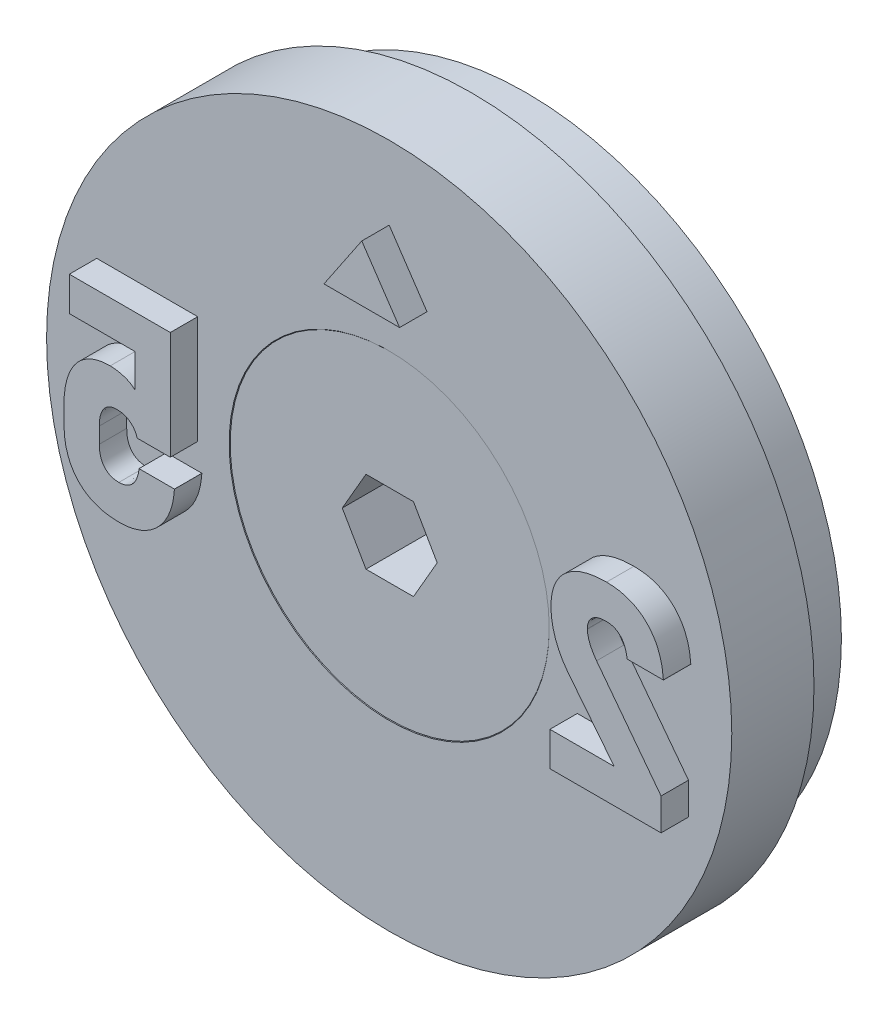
ISO-10303-21;
HEADER;
FILE_DESCRIPTION(('STEP AP214'),'2;1');
FILE_NAME('part.step','',(''),(''),'','','');
FILE_SCHEMA(('AUTOMOTIVE_DESIGN { 1 0 10303 214 1 1 1 1 }'));
ENDSEC;
DATA;
#1=APPLICATION_CONTEXT('core data for automotive mechanical design processes');
#2=APPLICATION_PROTOCOL_DEFINITION('international standard','automotive_design',2000,#1);
#3=PRODUCT_CONTEXT('',#1,'mechanical');
#4=PRODUCT('Part','Part','',(#3));
#5=PRODUCT_RELATED_PRODUCT_CATEGORY('part','',(#4));
#6=PRODUCT_DEFINITION_FORMATION('','',#4);
#7=PRODUCT_DEFINITION_CONTEXT('part definition',#1,'design');
#8=PRODUCT_DEFINITION('design','',#6,#7);
#9=PRODUCT_DEFINITION_SHAPE('','',#8);
#10=(LENGTH_UNIT() NAMED_UNIT(*) SI_UNIT(.MILLI.,.METRE.));
#11=(NAMED_UNIT(*) PLANE_ANGLE_UNIT() SI_UNIT($,.RADIAN.));
#12=(NAMED_UNIT(*) SI_UNIT($,.STERADIAN.) SOLID_ANGLE_UNIT());
#13=UNCERTAINTY_MEASURE_WITH_UNIT(LENGTH_MEASURE(1.E-05),#10,'distance_accuracy_value','');
#14=(GEOMETRIC_REPRESENTATION_CONTEXT(3) GLOBAL_UNCERTAINTY_ASSIGNED_CONTEXT((#13)) GLOBAL_UNIT_ASSIGNED_CONTEXT((#10,
#11,#12)) REPRESENTATION_CONTEXT('',''));
#15=CARTESIAN_POINT('',(0.,0.,0.));
#16=DIRECTION('',(0.,0.,1.));
#17=DIRECTION('',(1.,0.,0.));
#18=AXIS2_PLACEMENT_3D('',#15,#16,#17);
#19=CARTESIAN_POINT('',(0.,0.,-0.0200000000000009));
#20=DIRECTION('',(0.,0.,1.));
#21=DIRECTION('',(1.,0.,0.));
#22=AXIS2_PLACEMENT_3D('',#19,#20,#21);
#23=CYLINDRICAL_SURFACE('',#22,2.5);
#24=CARTESIAN_POINT('',(0.,0.,-3.34));
#25=DIRECTION('',(0.,0.,1.));
#26=DIRECTION('',(1.,0.,0.));
#27=AXIS2_PLACEMENT_3D('',#24,#25,#26);
#28=CIRCLE('',#27,2.5);
#29=CARTESIAN_POINT('',(2.5,0.,-3.34));
#30=VERTEX_POINT('',#29);
#31=EDGE_CURVE('E12',#30,#30,#28,.T.);
#32=ORIENTED_EDGE('',*,*,#31,.F.);
#33=EDGE_LOOP('',(#32));
#34=FACE_BOUND('',#33,.T.);
#35=CARTESIAN_POINT('',(0.,0.,-9.77));
#36=DIRECTION('',(0.,0.,1.));
#37=DIRECTION('',(1.,0.,0.));
#38=AXIS2_PLACEMENT_3D('',#35,#36,#37);
#39=CIRCLE('',#38,2.5);
#40=CARTESIAN_POINT('',(2.5,0.,-9.77));
#41=VERTEX_POINT('',#40);
#42=EDGE_CURVE('E147',#41,#41,#39,.T.);
#43=ORIENTED_EDGE('',*,*,#42,.T.);
#44=EDGE_LOOP('',(#43));
#45=FACE_BOUND('',#44,.T.);
#46=ADVANCED_FACE('F46',(#34,#45),#23,.T.);
#47=CARTESIAN_POINT('',(0.,0.,-3.34));
#48=DIRECTION('',(0.,0.,1.));
#49=DIRECTION('',(1.,0.,0.));
#50=AXIS2_PLACEMENT_3D('',#47,#48,#49);
#51=CONICAL_SURFACE('',#50,2.5,0.785398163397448);
#52=CARTESIAN_POINT('',(0.,0.,-0.0200000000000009));
#53=DIRECTION('',(0.,0.,1.));
#54=DIRECTION('',(1.,0.,0.));
#55=AXIS2_PLACEMENT_3D('',#52,#53,#54);
#56=CIRCLE('',#55,5.82);
#57=CARTESIAN_POINT('',(5.82,0.,-0.0200000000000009));
#58=VERTEX_POINT('',#57);
#59=EDGE_CURVE('E53',#58,#58,#56,.T.);
#60=ORIENTED_EDGE('',*,*,#59,.F.);
#61=EDGE_LOOP('',(#60));
#62=FACE_BOUND('',#61,.T.);
#63=ORIENTED_EDGE('',*,*,#31,.T.);
#64=EDGE_LOOP('',(#63));
#65=FACE_BOUND('',#64,.T.);
#66=ADVANCED_FACE('F162',(#62,#65),#51,.T.);
#67=CARTESIAN_POINT('',(0.,5.82,-0.0200000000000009));
#68=DIRECTION('',(0.,0.,-1.));
#69=DIRECTION('',(-1.,0.,0.));
#70=AXIS2_PLACEMENT_3D('',#67,#68,#69);
#71=PLANE('',#70);
#72=DIRECTION('',(1.,0.,0.));
#73=VECTOR('',#72,1.);
#74=CARTESIAN_POINT('',(-0.866025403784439,-1.5,-0.0200000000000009));
#75=LINE('',#74,#73);
#76=CARTESIAN_POINT('',(-0.866025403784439,-1.5,-0.0200000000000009));
#77=VERTEX_POINT('',#76);
#78=CARTESIAN_POINT('',(0.866025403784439,-1.5,-0.0200000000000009));
#79=VERTEX_POINT('',#78);
#80=EDGE_CURVE('E134',#77,#79,#75,.T.);
#81=ORIENTED_EDGE('',*,*,#80,.F.);
#82=DIRECTION('',(0.5,-0.866025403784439,0.));
#83=VECTOR('',#82,1.);
#84=CARTESIAN_POINT('',(-1.73205080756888,0.,-0.0200000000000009));
#85=LINE('',#84,#83);
#86=CARTESIAN_POINT('',(-1.73205080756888,0.,-0.0200000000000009));
#87=VERTEX_POINT('',#86);
#88=EDGE_CURVE('E60',#87,#77,#85,.T.);
#89=ORIENTED_EDGE('',*,*,#88,.F.);
#90=DIRECTION('',(-0.5,-0.866025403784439,0.));
#91=VECTOR('',#90,1.);
#92=CARTESIAN_POINT('',(-0.866025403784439,1.5,-0.0200000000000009));
#93=LINE('',#92,#91);
#94=CARTESIAN_POINT('',(-0.866025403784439,1.5,-0.0200000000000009));
#95=VERTEX_POINT('',#94);
#96=EDGE_CURVE('E143',#95,#87,#93,.T.);
#97=ORIENTED_EDGE('',*,*,#96,.F.);
#98=DIRECTION('',(-1.,0.,0.));
#99=VECTOR('',#98,1.);
#100=CARTESIAN_POINT('',(0.866025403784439,1.5,-0.0200000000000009));
#101=LINE('',#100,#99);
#102=CARTESIAN_POINT('',(0.866025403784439,1.5,-0.0200000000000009));
#103=VERTEX_POINT('',#102);
#104=EDGE_CURVE('E141',#103,#95,#101,.T.);
#105=ORIENTED_EDGE('',*,*,#104,.F.);
#106=DIRECTION('',(-0.5,0.866025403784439,0.));
#107=VECTOR('',#106,1.);
#108=CARTESIAN_POINT('',(1.73205080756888,0.,-0.0200000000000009));
#109=LINE('',#108,#107);
#110=CARTESIAN_POINT('',(1.73205080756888,0.,-0.0200000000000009));
#111=VERTEX_POINT('',#110);
#112=EDGE_CURVE('E108',#111,#103,#109,.T.);
#113=ORIENTED_EDGE('',*,*,#112,.F.);
#114=DIRECTION('',(0.5,0.866025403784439,0.));
#115=VECTOR('',#114,1.);
#116=CARTESIAN_POINT('',(0.866025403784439,-1.5,-0.0200000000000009));
#117=LINE('',#116,#115);
#118=EDGE_CURVE('E137',#79,#111,#117,.T.);
#119=ORIENTED_EDGE('',*,*,#118,.F.);
#120=EDGE_LOOP('',(#81,#89,#97,#105,#113,#119));
#121=FACE_BOUND('',#120,.T.);
#122=ORIENTED_EDGE('',*,*,#59,.T.);
#123=EDGE_LOOP('',(#122));
#124=FACE_BOUND('',#123,.T.);
#125=ADVANCED_FACE('F160',(#121,#124),#71,.F.);
#126=CARTESIAN_POINT('',(0.,0.,-10.02));
#127=DIRECTION('',(0.,0.,1.));
#128=DIRECTION('',(1.,0.,0.));
#129=AXIS2_PLACEMENT_3D('',#126,#127,#128);
#130=PLANE('',#129);
#131=CARTESIAN_POINT('',(0.,0.,-10.02));
#132=DIRECTION('',(0.,0.,1.));
#133=DIRECTION('',(1.,0.,0.));
#134=AXIS2_PLACEMENT_3D('',#131,#132,#133);
#135=CIRCLE('',#134,2.25);
#136=CARTESIAN_POINT('',(2.25,0.,-10.02));
#137=VERTEX_POINT('',#136);
#138=EDGE_CURVE('E155',#137,#137,#135,.T.);
#139=ORIENTED_EDGE('',*,*,#138,.F.);
#140=EDGE_LOOP('',(#139));
#141=FACE_BOUND('',#140,.T.);
#142=ADVANCED_FACE('F175',(#141),#130,.F.);
#143=CARTESIAN_POINT('',(0.,0.,-10.02));
#144=DIRECTION('',(0.,0.,1.));
#145=DIRECTION('',(1.,0.,0.));
#146=AXIS2_PLACEMENT_3D('',#143,#144,#145);
#147=CONICAL_SURFACE('',#146,2.25,0.78539816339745);
#148=ORIENTED_EDGE('',*,*,#42,.F.);
#149=EDGE_LOOP('',(#148));
#150=FACE_BOUND('',#149,.T.);
#151=ORIENTED_EDGE('',*,*,#138,.T.);
#152=EDGE_LOOP('',(#151));
#153=FACE_BOUND('',#152,.T.);
#154=ADVANCED_FACE('F171',(#150,#153),#147,.T.);
#155=CARTESIAN_POINT('',(-1.73205080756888,0.,-2.52));
#156=DIRECTION('',(-0.866025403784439,-0.5,0.));
#157=DIRECTION('',(0.5,-0.866025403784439,0.));
#158=AXIS2_PLACEMENT_3D('',#155,#156,#157);
#159=PLANE('',#158);
#160=ORIENTED_EDGE('',*,*,#88,.T.);
#161=DIRECTION('',(0.,0.,1.));
#162=VECTOR('',#161,1.);
#163=CARTESIAN_POINT('',(-0.866025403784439,-1.5,-2.52));
#164=LINE('',#163,#162);
#165=CARTESIAN_POINT('',(-0.866025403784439,-1.5,-2.52));
#166=VERTEX_POINT('',#165);
#167=EDGE_CURVE('E90',#166,#77,#164,.T.);
#168=ORIENTED_EDGE('',*,*,#167,.F.);
#169=DIRECTION('',(0.5,-0.866025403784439,0.));
#170=VECTOR('',#169,1.);
#171=CARTESIAN_POINT('',(-1.73205080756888,0.,-2.52));
#172=LINE('',#171,#170);
#173=CARTESIAN_POINT('',(-1.73205080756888,0.,-2.52));
#174=VERTEX_POINT('',#173);
#175=EDGE_CURVE('E145',#174,#166,#172,.T.);
#176=ORIENTED_EDGE('',*,*,#175,.F.);
#177=DIRECTION('',(0.,0.,1.));
#178=VECTOR('',#177,1.);
#179=CARTESIAN_POINT('',(-1.73205080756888,0.,-2.52));
#180=LINE('',#179,#178);
#181=EDGE_CURVE('E68',#174,#87,#180,.T.);
#182=ORIENTED_EDGE('',*,*,#181,.T.);
#183=EDGE_LOOP('',(#160,#168,#176,#182));
#184=FACE_BOUND('',#183,.T.);
#185=ADVANCED_FACE('F174',(#184),#159,.F.);
#186=CARTESIAN_POINT('',(-0.866025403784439,1.5,-2.52));
#187=DIRECTION('',(-0.866025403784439,0.5,0.));
#188=DIRECTION('',(-0.5,-0.866025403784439,0.));
#189=AXIS2_PLACEMENT_3D('',#186,#187,#188);
#190=PLANE('',#189);
#191=ORIENTED_EDGE('',*,*,#96,.T.);
#192=ORIENTED_EDGE('',*,*,#181,.F.);
#193=DIRECTION('',(-0.5,-0.866025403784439,0.));
#194=VECTOR('',#193,1.);
#195=CARTESIAN_POINT('',(-0.866025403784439,1.5,-2.52));
#196=LINE('',#195,#194);
#197=CARTESIAN_POINT('',(-0.866025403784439,1.5,-2.52));
#198=VERTEX_POINT('',#197);
#199=EDGE_CURVE('E120',#198,#174,#196,.T.);
#200=ORIENTED_EDGE('',*,*,#199,.F.);
#201=DIRECTION('',(0.,0.,1.));
#202=VECTOR('',#201,1.);
#203=CARTESIAN_POINT('',(-0.866025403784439,1.5,-2.52));
#204=LINE('',#203,#202);
#205=EDGE_CURVE('E112',#198,#95,#204,.T.);
#206=ORIENTED_EDGE('',*,*,#205,.T.);
#207=EDGE_LOOP('',(#191,#192,#200,#206));
#208=FACE_BOUND('',#207,.T.);
#209=ADVANCED_FACE('F190',(#208),#190,.F.);
#210=CARTESIAN_POINT('',(0.866025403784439,1.5,-2.52));
#211=DIRECTION('',(0.,1.,0.));
#212=DIRECTION('',(-1.,0.,0.));
#213=AXIS2_PLACEMENT_3D('',#210,#211,#212);
#214=PLANE('',#213);
#215=ORIENTED_EDGE('',*,*,#104,.T.);
#216=ORIENTED_EDGE('',*,*,#205,.F.);
#217=DIRECTION('',(-1.,0.,0.));
#218=VECTOR('',#217,1.);
#219=CARTESIAN_POINT('',(0.866025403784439,1.5,-2.52));
#220=LINE('',#219,#218);
#221=CARTESIAN_POINT('',(0.866025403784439,1.5,-2.52));
#222=VERTEX_POINT('',#221);
#223=EDGE_CURVE('E116',#222,#198,#220,.T.);
#224=ORIENTED_EDGE('',*,*,#223,.F.);
#225=DIRECTION('',(0.,0.,1.));
#226=VECTOR('',#225,1.);
#227=CARTESIAN_POINT('',(0.866025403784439,1.5,-2.52));
#228=LINE('',#227,#226);
#229=EDGE_CURVE('E101',#222,#103,#228,.T.);
#230=ORIENTED_EDGE('',*,*,#229,.T.);
#231=EDGE_LOOP('',(#215,#216,#224,#230));
#232=FACE_BOUND('',#231,.T.);
#233=ADVANCED_FACE('F117',(#232),#214,.F.);
#234=CARTESIAN_POINT('',(1.73205080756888,0.,-2.52));
#235=DIRECTION('',(0.866025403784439,0.5,0.));
#236=DIRECTION('',(-0.5,0.866025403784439,0.));
#237=AXIS2_PLACEMENT_3D('',#234,#235,#236);
#238=PLANE('',#237);
#239=ORIENTED_EDGE('',*,*,#112,.T.);
#240=ORIENTED_EDGE('',*,*,#229,.F.);
#241=DIRECTION('',(-0.5,0.866025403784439,0.));
#242=VECTOR('',#241,1.);
#243=CARTESIAN_POINT('',(1.73205080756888,0.,-2.52));
#244=LINE('',#243,#242);
#245=CARTESIAN_POINT('',(1.73205080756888,0.,-2.52));
#246=VERTEX_POINT('',#245);
#247=EDGE_CURVE('E105',#246,#222,#244,.T.);
#248=ORIENTED_EDGE('',*,*,#247,.F.);
#249=DIRECTION('',(0.,0.,1.));
#250=VECTOR('',#249,1.);
#251=CARTESIAN_POINT('',(1.73205080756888,0.,-2.52));
#252=LINE('',#251,#250);
#253=EDGE_CURVE('E113',#246,#111,#252,.T.);
#254=ORIENTED_EDGE('',*,*,#253,.T.);
#255=EDGE_LOOP('',(#239,#240,#248,#254));
#256=FACE_BOUND('',#255,.T.);
#257=ADVANCED_FACE('F103',(#256),#238,.F.);
#258=CARTESIAN_POINT('',(0.866025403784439,-1.5,-2.52));
#259=DIRECTION('',(0.866025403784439,-0.5,0.));
#260=DIRECTION('',(0.5,0.866025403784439,0.));
#261=AXIS2_PLACEMENT_3D('',#258,#259,#260);
#262=PLANE('',#261);
#263=ORIENTED_EDGE('',*,*,#118,.T.);
#264=ORIENTED_EDGE('',*,*,#253,.F.);
#265=DIRECTION('',(0.5,0.866025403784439,0.));
#266=VECTOR('',#265,1.);
#267=CARTESIAN_POINT('',(0.866025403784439,-1.5,-2.52));
#268=LINE('',#267,#266);
#269=CARTESIAN_POINT('',(0.866025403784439,-1.5,-2.52));
#270=VERTEX_POINT('',#269);
#271=EDGE_CURVE('E126',#270,#246,#268,.T.);
#272=ORIENTED_EDGE('',*,*,#271,.F.);
#273=DIRECTION('',(0.,0.,1.));
#274=VECTOR('',#273,1.);
#275=CARTESIAN_POINT('',(0.866025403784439,-1.5,-2.52));
#276=LINE('',#275,#274);
#277=EDGE_CURVE('E150',#270,#79,#276,.T.);
#278=ORIENTED_EDGE('',*,*,#277,.T.);
#279=EDGE_LOOP('',(#263,#264,#272,#278));
#280=FACE_BOUND('',#279,.T.);
#281=ADVANCED_FACE('F194',(#280),#262,.F.);
#282=CARTESIAN_POINT('',(-0.866025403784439,-1.5,-2.52));
#283=DIRECTION('',(0.,-1.,0.));
#284=DIRECTION('',(0.,0.,-1.));
#285=AXIS2_PLACEMENT_3D('',#282,#283,#284);
#286=PLANE('',#285);
#287=ORIENTED_EDGE('',*,*,#80,.T.);
#288=ORIENTED_EDGE('',*,*,#277,.F.);
#289=DIRECTION('',(1.,0.,0.));
#290=VECTOR('',#289,1.);
#291=CARTESIAN_POINT('',(-0.866025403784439,-1.5,-2.52));
#292=LINE('',#291,#290);
#293=EDGE_CURVE('E128',#166,#270,#292,.T.);
#294=ORIENTED_EDGE('',*,*,#293,.F.);
#295=ORIENTED_EDGE('',*,*,#167,.T.);
#296=EDGE_LOOP('',(#287,#288,#294,#295));
#297=FACE_BOUND('',#296,.T.);
#298=ADVANCED_FACE('F191',(#297),#286,.F.);
#299=CARTESIAN_POINT('',(0.,0.,-2.52));
#300=DIRECTION('',(0.,0.,1.));
#301=DIRECTION('',(1.,0.,0.));
#302=AXIS2_PLACEMENT_3D('',#299,#300,#301);
#303=PLANE('',#302);
#304=ORIENTED_EDGE('',*,*,#175,.T.);
#305=ORIENTED_EDGE('',*,*,#293,.T.);
#306=ORIENTED_EDGE('',*,*,#271,.T.);
#307=ORIENTED_EDGE('',*,*,#247,.T.);
#308=ORIENTED_EDGE('',*,*,#223,.T.);
#309=ORIENTED_EDGE('',*,*,#199,.T.);
#310=EDGE_LOOP('',(#304,#305,#306,#307,#308,#309));
#311=FACE_BOUND('',#310,.T.);
#312=ADVANCED_FACE('F123',(#311),#303,.T.);
#313=CLOSED_SHELL('',(#46,#66,#125,#142,#154,#185,#209,#233,#257,#281,#298,#312));
#314=MANIFOLD_SOLID_BREP('B2',#313);
#315=CARTESIAN_POINT('',(1.3800444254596,7.76799984,1.));
#316=DIRECTION('',(-0.829037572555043,-0.559192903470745,0.));
#317=DIRECTION('',(0.559192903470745,-0.829037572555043,0.));
#318=AXIS2_PLACEMENT_3D('',#315,#316,#317);
#319=PLANE('',#318);
#320=DIRECTION('',(-0.559192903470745,0.829037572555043,0.));
#321=VECTOR('',#320,1.);
#322=CARTESIAN_POINT('',(1.3800444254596,7.76799984,0.));
#323=LINE('',#322,#321);
#324=CARTESIAN_POINT('',(1.3800444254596,7.76799984,0.));
#325=VERTEX_POINT('',#324);
#326=CARTESIAN_POINT('',(0.,9.81399984,0.));
#327=VERTEX_POINT('',#326);
#328=EDGE_CURVE('E314',#325,#327,#323,.T.);
#329=ORIENTED_EDGE('',*,*,#328,.T.);
#330=DIRECTION('',(0.,0.,-1.));
#331=VECTOR('',#330,1.);
#332=CARTESIAN_POINT('',(0.,9.81399984,1.));
#333=LINE('',#332,#331);
#334=CARTESIAN_POINT('',(0.,9.81399984,1.));
#335=VERTEX_POINT('',#334);
#336=EDGE_CURVE('E44',#335,#327,#333,.T.);
#337=ORIENTED_EDGE('',*,*,#336,.F.);
#338=DIRECTION('',(-0.559192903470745,0.829037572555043,0.));
#339=VECTOR('',#338,1.);
#340=CARTESIAN_POINT('',(1.3800444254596,7.76799984,1.));
#341=LINE('',#340,#339);
#342=CARTESIAN_POINT('',(1.3800444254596,7.76799984,1.));
#343=VERTEX_POINT('',#342);
#344=EDGE_CURVE('E307',#343,#335,#341,.T.);
#345=ORIENTED_EDGE('',*,*,#344,.F.);
#346=DIRECTION('',(0.,0.,-1.));
#347=VECTOR('',#346,1.);
#348=CARTESIAN_POINT('',(1.3800444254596,7.76799984,1.));
#349=LINE('',#348,#347);
#350=EDGE_CURVE('E315',#343,#325,#349,.T.);
#351=ORIENTED_EDGE('',*,*,#350,.T.);
#352=EDGE_LOOP('',(#329,#337,#345,#351));
#353=FACE_BOUND('',#352,.T.);
#354=ADVANCED_FACE('F267',(#353),#319,.F.);
#355=CARTESIAN_POINT('',(0.,9.81399984,1.));
#356=DIRECTION('',(0.829037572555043,-0.559192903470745,0.));
#357=DIRECTION('',(0.559192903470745,0.829037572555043,0.));
#358=AXIS2_PLACEMENT_3D('',#355,#356,#357);
#359=PLANE('',#358);
#360=DIRECTION('',(-0.559192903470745,-0.829037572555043,0.));
#361=VECTOR('',#360,1.);
#362=CARTESIAN_POINT('',(0.,9.81399984,0.));
#363=LINE('',#362,#361);
#364=CARTESIAN_POINT('',(-1.3800444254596,7.76799984,0.));
#365=VERTEX_POINT('',#364);
#366=EDGE_CURVE('E295',#327,#365,#363,.T.);
#367=ORIENTED_EDGE('',*,*,#366,.T.);
#368=DIRECTION('',(0.,0.,-1.));
#369=VECTOR('',#368,1.);
#370=CARTESIAN_POINT('',(-1.3800444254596,7.76799984,1.));
#371=LINE('',#370,#369);
#372=CARTESIAN_POINT('',(-1.3800444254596,7.76799984,1.));
#373=VERTEX_POINT('',#372);
#374=EDGE_CURVE('E275',#373,#365,#371,.T.);
#375=ORIENTED_EDGE('',*,*,#374,.F.);
#376=DIRECTION('',(-0.559192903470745,-0.829037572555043,0.));
#377=VECTOR('',#376,1.);
#378=CARTESIAN_POINT('',(0.,9.81399984,1.));
#379=LINE('',#378,#377);
#380=EDGE_CURVE('E303',#335,#373,#379,.T.);
#381=ORIENTED_EDGE('',*,*,#380,.F.);
#382=ORIENTED_EDGE('',*,*,#336,.T.);
#383=EDGE_LOOP('',(#367,#375,#381,#382));
#384=FACE_BOUND('',#383,.T.);
#385=ADVANCED_FACE('F304',(#384),#359,.F.);
#386=CARTESIAN_POINT('',(-1.3800444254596,7.76799984,1.));
#387=DIRECTION('',(0.,1.,0.));
#388=DIRECTION('',(0.,0.,1.));
#389=AXIS2_PLACEMENT_3D('',#386,#387,#388);
#390=PLANE('',#389);
#391=DIRECTION('',(1.,0.,0.));
#392=VECTOR('',#391,1.);
#393=CARTESIAN_POINT('',(-1.3800444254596,7.76799984,0.));
#394=LINE('',#393,#392);
#395=EDGE_CURVE('E300',#365,#325,#394,.T.);
#396=ORIENTED_EDGE('',*,*,#395,.T.);
#397=ORIENTED_EDGE('',*,*,#350,.F.);
#398=DIRECTION('',(1.,0.,0.));
#399=VECTOR('',#398,1.);
#400=CARTESIAN_POINT('',(-1.3800444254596,7.76799984,1.));
#401=LINE('',#400,#399);
#402=EDGE_CURVE('E283',#373,#343,#401,.T.);
#403=ORIENTED_EDGE('',*,*,#402,.F.);
#404=ORIENTED_EDGE('',*,*,#374,.T.);
#405=EDGE_LOOP('',(#396,#397,#403,#404));
#406=FACE_BOUND('',#405,.T.);
#407=ADVANCED_FACE('F322',(#406),#390,.F.);
#408=CARTESIAN_POINT('',(0.,0.,1.));
#409=DIRECTION('',(0.,0.,1.));
#410=DIRECTION('',(1.,0.,0.));
#411=AXIS2_PLACEMENT_3D('',#408,#409,#410);
#412=PLANE('',#411);
#413=ORIENTED_EDGE('',*,*,#344,.T.);
#414=ORIENTED_EDGE('',*,*,#380,.T.);
#415=ORIENTED_EDGE('',*,*,#402,.T.);
#416=EDGE_LOOP('',(#413,#414,#415));
#417=FACE_BOUND('',#416,.T.);
#418=ADVANCED_FACE('F310',(#417),#412,.T.);
#419=CARTESIAN_POINT('',(0.,0.,0.));
#420=DIRECTION('',(0.,0.,1.));
#421=DIRECTION('',(1.,0.,0.));
#422=AXIS2_PLACEMENT_3D('',#419,#420,#421);
#423=PLANE('',#422);
#424=ORIENTED_EDGE('',*,*,#328,.F.);
#425=ORIENTED_EDGE('',*,*,#395,.F.);
#426=ORIENTED_EDGE('',*,*,#366,.F.);
#427=EDGE_LOOP('',(#424,#425,#426));
#428=FACE_BOUND('',#427,.T.);
#429=ADVANCED_FACE('F323',(#428),#423,.F.);
#430=CLOSED_SHELL('',(#354,#385,#407,#418,#429));
#431=MANIFOLD_SOLID_BREP('B6',#430);
#432=CARTESIAN_POINT('',(0.,12.5,0.));
#433=DIRECTION('',(0.,0.,-1.));
#434=DIRECTION('',(-1.,0.,0.));
#435=AXIS2_PLACEMENT_3D('',#432,#433,#434);
#436=PLANE('',#435);
#437=DIRECTION('',(0.,1.,0.));
#438=VECTOR('',#437,1.);
#439=CARTESIAN_POINT('',(10.919877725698,-3.429,0.));
#440=LINE('',#439,#438);
#441=CARTESIAN_POINT('',(10.919877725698,-3.429,0.));
#442=VERTEX_POINT('',#441);
#443=CARTESIAN_POINT('',(10.919877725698,-2.26340554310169,0.));
#444=VERTEX_POINT('',#443);
#445=EDGE_CURVE('E619',#442,#444,#440,.T.);
#446=ORIENTED_EDGE('',*,*,#445,.F.);
#447=DIRECTION('',(1.,0.,0.));
#448=VECTOR('',#447,1.);
#449=CARTESIAN_POINT('',(6.86405624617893,-3.429,0.));
#450=LINE('',#449,#448);
#451=CARTESIAN_POINT('',(6.86405624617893,-3.429,0.));
#452=VERTEX_POINT('',#451);
#453=EDGE_CURVE('E632',#452,#442,#450,.T.);
#454=ORIENTED_EDGE('',*,*,#453,.F.);
#455=DIRECTION('',(0.,-1.,0.));
#456=VECTOR('',#455,1.);
#457=CARTESIAN_POINT('',(6.86405624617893,-2.18374261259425,0.));
#458=LINE('',#457,#456);
#459=CARTESIAN_POINT('',(6.86405624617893,-2.18374261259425,0.));
#460=VERTEX_POINT('',#459);
#461=EDGE_CURVE('E1063',#460,#452,#458,.T.);
#462=ORIENTED_EDGE('',*,*,#461,.F.);
#463=DIRECTION('',(-1.,0.,0.));
#464=VECTOR('',#463,1.);
#465=CARTESIAN_POINT('',(9.20782351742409,-2.18374261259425,0.));
#466=LINE('',#465,#464);
#467=CARTESIAN_POINT('',(9.20782351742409,-2.18374261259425,0.));
#468=VERTEX_POINT('',#467);
#469=EDGE_CURVE('E1060',#468,#460,#466,.T.);
#470=ORIENTED_EDGE('',*,*,#469,.F.);
#471=DIRECTION('',(0.620676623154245,-0.78406666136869,0.));
#472=VECTOR('',#471,1.);
#473=CARTESIAN_POINT('',(7.51952842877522,-0.0510122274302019,0.));
#474=LINE('',#473,#472);
#475=CARTESIAN_POINT('',(7.51952842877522,-0.051012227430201,0.));
#476=VERTEX_POINT('',#475);
#477=EDGE_CURVE('E1054',#476,#468,#474,.T.);
#478=ORIENTED_EDGE('',*,*,#477,.F.);
#479=CARTESIAN_POINT('',(6.90179131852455,1.70716262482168,0.));
#480=CARTESIAN_POINT('',(6.90358309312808,1.62926486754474,0.));
#481=CARTESIAN_POINT('',(6.90716991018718,1.47332728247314,0.));
#482=CARTESIAN_POINT('',(6.93915967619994,1.24036145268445,0.));
#483=CARTESIAN_POINT('',(6.99146768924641,1.00874165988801,0.));
#484=CARTESIAN_POINT('',(7.06244262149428,0.779279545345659,0.));
#485=CARTESIAN_POINT('',(7.15107066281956,0.555806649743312,0.));
#486=CARTESIAN_POINT('',(7.25684213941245,0.341884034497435,0.));
#487=CARTESIAN_POINT('',(7.37760123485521,0.138057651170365,0.));
#488=CARTESIAN_POINT('',(7.47222598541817,0.012002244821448,0.));
#489=CARTESIAN_POINT('',(7.51952842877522,-0.0510122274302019,0.));
#490=B_SPLINE_CURVE_WITH_KNOTS('',3,(#479,#480,#481,#482,#483,#484,#485,#486,#487,#488,#489),
.UNSPECIFIED.,.F.,.F.,(4,1,1,1,1,1,1,1,4),(0.,0.123148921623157,0.246522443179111,
0.371108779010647,0.498350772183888,0.625999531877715,0.750879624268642,0.875465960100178,1.),.UNSPECIFIED.);
#491=CARTESIAN_POINT('',(6.90179131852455,1.70716262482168,0.));
#492=VERTEX_POINT('',#491);
#493=EDGE_CURVE('E1049',#492,#476,#490,.T.);
#494=ORIENTED_EDGE('',*,*,#493,.F.);
#495=DIRECTION('',(0.,-1.,0.));
#496=VECTOR('',#495,1.);
#497=CARTESIAN_POINT('',(6.90179131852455,1.71275300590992,0.));
#498=LINE('',#497,#496);
#499=CARTESIAN_POINT('',(6.90179131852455,1.71275300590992,0.));
#500=VERTEX_POINT('',#499);
#501=EDGE_CURVE('E1043',#500,#492,#498,.T.);
#502=ORIENTED_EDGE('',*,*,#501,.F.);
#503=CARTESIAN_POINT('',(8.92970205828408,3.50027735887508,0.));
#504=CARTESIAN_POINT('',(8.82661758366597,3.49812235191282,0.));
#505=CARTESIAN_POINT('',(8.62710387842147,3.49395146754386,0.));
#506=CARTESIAN_POINT('',(8.33981754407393,3.45468735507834,0.));
#507=CARTESIAN_POINT('',(8.07565279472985,3.38934736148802,0.));
#508=CARTESIAN_POINT('',(7.83527235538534,3.29754724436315,0.));
#509=CARTESIAN_POINT('',(7.62025469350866,3.17954043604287,0.));
#510=CARTESIAN_POINT('',(7.42960469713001,3.03946832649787,0.));
#511=CARTESIAN_POINT('',(7.26870532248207,2.87189330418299,0.));
#512=CARTESIAN_POINT('',(7.13486880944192,2.68152557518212,0.));
#513=CARTESIAN_POINT('',(7.0293646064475,2.46909971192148,0.));
#514=CARTESIAN_POINT('',(6.9554803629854,2.2347989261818,0.));
#515=CARTESIAN_POINT('',(6.91023317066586,1.98050526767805,0.));
#516=CARTESIAN_POINT('',(6.90466161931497,1.80379102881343,0.));
#517=CARTESIAN_POINT('',(6.90179131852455,1.71275300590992,0.));
#518=B_SPLINE_CURVE_WITH_KNOTS('',3,(#503,#504,#505,#506,#507,#508,#509,#510,#511,#512,#513,
#514,#515,#516,#517),.UNSPECIFIED.,.F.,.F.,(4,1,1,1,1,1,1,1,1,1,1,1,4),(0.,0.100715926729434,
0.194929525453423,0.282728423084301,0.366191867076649,0.44566981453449,0.521804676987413,
0.596515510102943,0.67168287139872,0.748455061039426,0.827368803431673,0.911065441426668,1.),.UNSPECIFIED.);
#519=CARTESIAN_POINT('',(8.92970205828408,3.50027735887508,0.));
#520=VERTEX_POINT('',#519);
#521=EDGE_CURVE('E1035',#520,#500,#518,.T.);
#522=ORIENTED_EDGE('',*,*,#521,.F.);
#523=CARTESIAN_POINT('',(11.0051310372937,1.44860749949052,0.));
#524=CARTESIAN_POINT('',(10.9956378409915,1.55185335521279,0.));
#525=CARTESIAN_POINT('',(10.9771445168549,1.75298256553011,0.));
#526=CARTESIAN_POINT('',(10.9142619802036,2.04222247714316,0.));
#527=CARTESIAN_POINT('',(10.8213662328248,2.30836659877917,0.));
#528=CARTESIAN_POINT('',(10.7026790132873,2.55214952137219,0.));
#529=CARTESIAN_POINT('',(10.5571477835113,2.77049371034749,0.));
#530=CARTESIAN_POINT('',(10.3882882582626,2.96334030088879,0.));
#531=CARTESIAN_POINT('',(10.1942302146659,3.12694348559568,0.));
#532=CARTESIAN_POINT('',(9.97833500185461,3.26289145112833,0.));
#533=CARTESIAN_POINT('',(9.74154560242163,3.36928450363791,0.));
#534=CARTESIAN_POINT('',(9.48675783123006,3.44680341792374,0.));
#535=CARTESIAN_POINT('',(9.21358795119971,3.49149220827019,0.));
#536=CARTESIAN_POINT('',(9.02583304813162,3.49730248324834,0.));
#537=CARTESIAN_POINT('',(8.92970205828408,3.50027735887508,0.));
#538=B_SPLINE_CURVE_WITH_KNOTS('',3,(#523,#524,#525,#526,#527,#528,#529,#530,#531,#532,#533,
#534,#535,#536,#537),.UNSPECIFIED.,.F.,.F.,(4,1,1,1,1,1,1,1,1,1,1,1,4),(0.,0.0953291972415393,
0.185707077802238,0.271513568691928,0.35413169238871,0.434493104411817,0.512233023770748,
0.58917600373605,0.667186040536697,0.746219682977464,0.827302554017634,0.911578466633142,1.),.UNSPECIFIED.);
#539=CARTESIAN_POINT('',(11.0051310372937,1.44860749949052,0.));
#540=VERTEX_POINT('',#539);
#541=EDGE_CURVE('E1030',#540,#520,#538,.T.);
#542=ORIENTED_EDGE('',*,*,#541,.F.);
#543=DIRECTION('',(0.,1.,0.));
#544=VECTOR('',#543,1.);
#545=CARTESIAN_POINT('',(11.0051310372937,1.44301711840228,0.));
#546=LINE('',#545,#544);
#547=CARTESIAN_POINT('',(11.0051310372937,1.44301711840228,0.));
#548=VERTEX_POINT('',#547);
#549=EDGE_CURVE('E1027',#548,#540,#546,.T.);
#550=ORIENTED_EDGE('',*,*,#549,.F.);
#551=DIRECTION('',(1.,0.,0.));
#552=VECTOR('',#551,1.);
#553=CARTESIAN_POINT('',(9.68021071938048,1.44301711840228,0.));
#554=LINE('',#553,#552);
#555=CARTESIAN_POINT('',(9.68021071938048,1.44301711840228,0.));
#556=VERTEX_POINT('',#555);
#557=EDGE_CURVE('E1024',#556,#548,#554,.T.);
#558=ORIENTED_EDGE('',*,*,#557,.F.);
#559=DIRECTION('',(0.,-1.,0.));
#560=VECTOR('',#559,1.);
#561=CARTESIAN_POINT('',(9.68021071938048,1.44860749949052,0.));
#562=LINE('',#561,#560);
#563=CARTESIAN_POINT('',(9.68021071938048,1.44860749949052,0.));
#564=VERTEX_POINT('',#563);
#565=EDGE_CURVE('E1018',#564,#556,#562,.T.);
#566=ORIENTED_EDGE('',*,*,#565,.F.);
#567=CARTESIAN_POINT('',(8.91991889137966,2.25501997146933,0.));
#568=CARTESIAN_POINT('',(8.97095753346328,2.25286405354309,0.));
#569=CARTESIAN_POINT('',(9.07000738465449,2.24868009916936,0.));
#570=CARTESIAN_POINT('',(9.21090652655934,2.20881121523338,0.));
#571=CARTESIAN_POINT('',(9.33607200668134,2.14112528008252,0.));
#572=CARTESIAN_POINT('',(9.44442297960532,2.04758170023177,0.));
#573=CARTESIAN_POINT('',(9.53533926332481,1.92990369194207,0.));
#574=CARTESIAN_POINT('',(9.60235132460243,1.78814002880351,0.));
#575=CARTESIAN_POINT('',(9.65631723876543,1.6270195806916,0.));
#576=CARTESIAN_POINT('',(9.67197806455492,1.51008054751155,0.));
#577=CARTESIAN_POINT('',(9.68021071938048,1.44860749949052,0.));
#578=B_SPLINE_CURVE_WITH_KNOTS('',3,(#567,#568,#569,#570,#571,#572,#573,#574,#575,#576,#577),
.UNSPECIFIED.,.F.,.F.,(4,1,1,1,1,1,1,1,4),(0.,0.124212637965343,0.241057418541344,
0.353359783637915,0.468536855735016,0.587568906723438,0.713021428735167,0.849139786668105,1.),.UNSPECIFIED.);
#579=CARTESIAN_POINT('',(8.91991889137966,2.25501997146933,0.));
#580=VERTEX_POINT('',#579);
#581=EDGE_CURVE('E1010',#580,#564,#578,.T.);
#582=ORIENTED_EDGE('',*,*,#581,.F.);
#583=CARTESIAN_POINT('',(8.23230201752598,1.6750179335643,0.));
#584=CARTESIAN_POINT('',(8.2341776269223,1.71905514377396,0.));
#585=CARTESIAN_POINT('',(8.23775190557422,1.80297520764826,0.));
#586=CARTESIAN_POINT('',(8.27225832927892,1.9210421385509,0.));
#587=CARTESIAN_POINT('',(8.32931827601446,2.02313777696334,0.));
#588=CARTESIAN_POINT('',(8.40924379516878,2.10872287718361,0.));
#589=CARTESIAN_POINT('',(8.51090954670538,2.17449898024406,0.));
#590=CARTESIAN_POINT('',(8.63083074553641,2.22254791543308,0.));
#591=CARTESIAN_POINT('',(8.76964467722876,2.24973459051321,0.));
#592=CARTESIAN_POINT('',(8.86808758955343,2.25319698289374,0.));
#593=CARTESIAN_POINT('',(8.91991889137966,2.25501997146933,0.));
#594=B_SPLINE_CURVE_WITH_KNOTS('',3,(#583,#584,#585,#586,#587,#588,#589,#590,#591,#592,#593),
.UNSPECIFIED.,.F.,.F.,(4,1,1,1,1,1,1,1,4),(0.,0.129170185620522,0.246154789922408,
0.35773418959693,0.470108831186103,0.586692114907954,0.710769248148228,0.847716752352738,1.),.UNSPECIFIED.);
#595=CARTESIAN_POINT('',(8.23230201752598,1.6750179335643,0.));
#596=VERTEX_POINT('',#595);
#597=EDGE_CURVE('E1005',#596,#580,#594,.T.);
#598=ORIENTED_EDGE('',*,*,#597,.F.);
#599=DIRECTION('',(0.,1.,0.));
#600=VECTOR('',#599,1.);
#601=CARTESIAN_POINT('',(8.23230201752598,1.66523476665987,0.));
#602=LINE('',#601,#600);
#603=CARTESIAN_POINT('',(8.23230201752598,1.66523476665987,0.));
#604=VERTEX_POINT('',#603);
#605=EDGE_CURVE('E999',#604,#596,#602,.T.);
#606=ORIENTED_EDGE('',*,*,#605,.F.);
#607=CARTESIAN_POINT('',(8.5663272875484,0.830870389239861,0.));
#608=CARTESIAN_POINT('',(8.51696694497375,0.899353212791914,0.));
#609=CARTESIAN_POINT('',(8.42060528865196,1.03304592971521,0.));
#610=CARTESIAN_POINT('',(8.33439138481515,1.21744558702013,0.));
#611=CARTESIAN_POINT('',(8.27962250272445,1.36203407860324,0.));
#612=CARTESIAN_POINT('',(8.25430169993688,1.46691616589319,0.));
#613=CARTESIAN_POINT('',(8.23555730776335,1.56720710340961,0.));
#614=CARTESIAN_POINT('',(8.23337219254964,1.63300822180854,0.));
#615=CARTESIAN_POINT('',(8.23230201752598,1.66523476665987,0.));
#616=B_SPLINE_CURVE_WITH_KNOTS('',3,(#607,#608,#609,#610,#611,#612,#613,#614,#615),
.UNSPECIFIED.,.F.,.F.,(4,1,1,1,1,1,4),(0.,0.27673722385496,0.540248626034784,0.66563356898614,
0.784034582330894,0.894229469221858,1.),.UNSPECIFIED.);
#617=CARTESIAN_POINT('',(8.5663272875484,0.830870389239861,0.));
#618=VERTEX_POINT('',#617);
#619=EDGE_CURVE('E994',#618,#604,#616,.T.);
#620=ORIENTED_EDGE('',*,*,#619,.F.);
#621=DIRECTION('',(-0.60539313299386,0.795926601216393,0.));
#622=VECTOR('',#621,1.);
#623=CARTESIAN_POINT('',(10.919877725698,-2.26340554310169,0.));
#624=LINE('',#623,#622);
#625=EDGE_CURVE('E622',#444,#618,#624,.T.);
#626=ORIENTED_EDGE('',*,*,#625,.F.);
#627=EDGE_LOOP('',(#446,#454,#462,#470,#478,#494,#502,#522,#542,#550,#558,#566,#582,#598,#606,
#620,#626));
#628=FACE_BOUND('',#627,.T.);
#629=CARTESIAN_POINT('',(0.,0.,0.));
#630=DIRECTION('',(0.,0.,1.));
#631=DIRECTION('',(1.,0.,0.));
#632=AXIS2_PLACEMENT_3D('',#629,#630,#631);
#633=CIRCLE('',#632,5.84);
#634=CARTESIAN_POINT('',(5.84,0.,0.));
#635=VERTEX_POINT('',#634);
#636=EDGE_CURVE('E373',#635,#635,#633,.T.);
#637=ORIENTED_EDGE('',*,*,#636,.F.);
#638=EDGE_LOOP('',(#637));
#639=FACE_BOUND('',#638,.T.);
#640=CARTESIAN_POINT('',(0.,0.,0.));
#641=DIRECTION('',(0.,0.,1.));
#642=DIRECTION('',(1.,0.,0.));
#643=AXIS2_PLACEMENT_3D('',#640,#641,#642);
#644=CIRCLE('',#643,12.5);
#645=CARTESIAN_POINT('',(12.5,0.,0.));
#646=VERTEX_POINT('',#645);
#647=EDGE_CURVE('E265',#646,#646,#644,.T.);
#648=ORIENTED_EDGE('',*,*,#647,.T.);
#649=EDGE_LOOP('',(#648));
#650=FACE_BOUND('',#649,.T.);
#651=CARTESIAN_POINT('',(-10.8668995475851,-1.39549887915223,0.));
#652=CARTESIAN_POINT('',(-10.8638380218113,-1.50231014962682,0.));
#653=CARTESIAN_POINT('',(-10.8579154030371,-1.70893994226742,0.));
#654=CARTESIAN_POINT('',(-10.8155624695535,-2.00774148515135,0.));
#655=CARTESIAN_POINT('',(-10.739212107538,-2.28182951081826,0.));
#656=CARTESIAN_POINT('',(-10.636913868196,-2.53297602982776,0.));
#657=CARTESIAN_POINT('',(-10.5033336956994,-2.75619031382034,0.));
#658=CARTESIAN_POINT('',(-10.3433793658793,-2.95335794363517,0.));
#659=CARTESIAN_POINT('',(-10.154131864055,-3.11992654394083,0.));
#660=CARTESIAN_POINT('',(-9.940057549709,-3.26010810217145,0.));
#661=CARTESIAN_POINT('',(-9.69911950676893,-3.36761760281,0.));
#662=CARTESIAN_POINT('',(-9.43516793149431,-3.44571973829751,0.));
#663=CARTESIAN_POINT('',(-9.14715828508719,-3.49217525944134,0.));
#664=CARTESIAN_POINT('',(-8.94771051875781,-3.49751583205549,0.));
#665=CARTESIAN_POINT('',(-8.8445791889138,-3.50027735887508,0.));
#666=B_SPLINE_CURVE_WITH_KNOTS('',3,(#651,#652,#653,#654,#655,#656,#657,#658,#659,#660,#661,
#662,#663,#664,#665),.UNSPECIFIED.,.F.,.F.,(4,1,1,1,1,1,1,1,1,1,1,1,4),(0.,0.0965919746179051,
0.186860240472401,0.272108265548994,0.35332451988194,0.431359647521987,0.506505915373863,
0.582010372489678,0.658435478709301,0.737063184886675,0.819709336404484,0.906774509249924,1.),.UNSPECIFIED.);
#667=CARTESIAN_POINT('',(-10.8668995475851,-1.39549887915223,0.));
#668=VERTEX_POINT('',#667);
#669=CARTESIAN_POINT('',(-8.8445791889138,-3.50027735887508,0.));
#670=VERTEX_POINT('',#669);
#671=EDGE_CURVE('E618',#668,#670,#666,.T.);
#672=ORIENTED_EDGE('',*,*,#671,.F.);
#673=DIRECTION('',(0.,-1.,0.));
#674=VECTOR('',#673,1.);
#675=CARTESIAN_POINT('',(-10.8668995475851,-0.821087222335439,0.));
#676=LINE('',#675,#674);
#677=CARTESIAN_POINT('',(-10.8668995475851,-0.82108722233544,0.));
#678=VERTEX_POINT('',#677);
#679=EDGE_CURVE('E615',#678,#668,#676,.T.);
#680=ORIENTED_EDGE('',*,*,#679,.F.);
#681=CARTESIAN_POINT('',(-9.17860445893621,1.27810087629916,0.));
#682=CARTESIAN_POINT('',(-9.26455457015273,1.27537967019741,0.));
#683=CARTESIAN_POINT('',(-9.43125326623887,1.27010193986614,0.));
#684=CARTESIAN_POINT('',(-9.67170256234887,1.22262751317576,0.));
#685=CARTESIAN_POINT('',(-9.89329892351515,1.14656864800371,0.));
#686=CARTESIAN_POINT('',(-10.0942138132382,1.03698984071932,0.));
#687=CARTESIAN_POINT('',(-10.2746744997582,0.89964940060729,0.));
#688=CARTESIAN_POINT('',(-10.4314182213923,0.731830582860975,0.));
#689=CARTESIAN_POINT('',(-10.5654221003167,0.536268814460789,0.));
#690=CARTESIAN_POINT('',(-10.6750927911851,0.312833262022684,0.));
#691=CARTESIAN_POINT('',(-10.7614082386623,0.0634818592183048,0.));
#692=CARTESIAN_POINT('',(-10.8241017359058,-0.210044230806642,0.));
#693=CARTESIAN_POINT('',(-10.8598293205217,-0.508010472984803,0.));
#694=CARTESIAN_POINT('',(-10.8644881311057,-0.714307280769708,0.));
#695=CARTESIAN_POINT('',(-10.8668995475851,-0.821087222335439,0.));
#696=B_SPLINE_CURVE_WITH_KNOTS('',3,(#681,#682,#683,#684,#685,#686,#687,#688,#689,#690,#691,
#692,#693,#694,#695),.UNSPECIFIED.,.F.,.F.,(4,1,1,1,1,1,1,1,1,1,1,1,4),(0.,0.0843949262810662,
0.163682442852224,0.239848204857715,0.313806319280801,0.387615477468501,0.461788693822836,
0.538496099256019,0.61978489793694,0.705652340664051,0.797279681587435,0.895071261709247,1.),.UNSPECIFIED.);
#697=CARTESIAN_POINT('',(-9.17860445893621,1.27810087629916,0.));
#698=VERTEX_POINT('',#697);
#699=EDGE_CURVE('E701',#698,#678,#696,.T.);
#700=ORIENTED_EDGE('',*,*,#699,.F.);
#701=CARTESIAN_POINT('',(-8.27855310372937,0.972027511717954,0.));
#702=CARTESIAN_POINT('',(-8.30457241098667,0.995066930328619,0.));
#703=CARTESIAN_POINT('',(-8.35809615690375,1.04246081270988,0.));
#704=CARTESIAN_POINT('',(-8.45167106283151,1.10263781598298,0.));
#705=CARTESIAN_POINT('',(-8.55869203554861,1.15374832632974,0.));
#706=CARTESIAN_POINT('',(-8.71661141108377,1.2126137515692,0.));
#707=CARTESIAN_POINT('',(-8.92434752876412,1.26495936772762,0.));
#708=CARTESIAN_POINT('',(-9.09488433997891,1.27377372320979,0.));
#709=CARTESIAN_POINT('',(-9.17860445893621,1.27810087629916,0.));
#710=B_SPLINE_CURVE_WITH_KNOTS('',3,(#701,#702,#703,#704,#705,#706,#707,#708,#709),
.UNSPECIFIED.,.F.,.F.,(4,1,1,1,1,1,4),(0.,0.107291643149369,0.22070728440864,0.342410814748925,
0.473179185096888,0.741372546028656,1.),.UNSPECIFIED.);
#711=CARTESIAN_POINT('',(-8.27855310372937,0.972027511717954,0.));
#712=VERTEX_POINT('',#711);
#713=EDGE_CURVE('E823',#712,#698,#710,.T.);
#714=ORIENTED_EDGE('',*,*,#713,.F.);
#715=DIRECTION('',(0.,-1.,0.));
#716=VECTOR('',#715,1.);
#717=CARTESIAN_POINT('',(-8.27855310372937,2.18374261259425,0.));
#718=LINE('',#717,#716);
#719=CARTESIAN_POINT('',(-8.27855310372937,2.18374261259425,0.));
#720=VERTEX_POINT('',#719);
#721=EDGE_CURVE('E820',#720,#712,#718,.T.);
#722=ORIENTED_EDGE('',*,*,#721,.F.);
#723=DIRECTION('',(1.,0.,0.));
#724=VECTOR('',#723,1.);
#725=CARTESIAN_POINT('',(-10.6698386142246,2.18374261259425,0.));
#726=LINE('',#725,#724);
#727=CARTESIAN_POINT('',(-10.6698386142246,2.18374261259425,0.));
#728=VERTEX_POINT('',#727);
#729=EDGE_CURVE('E817',#728,#720,#726,.T.);
#730=ORIENTED_EDGE('',*,*,#729,.F.);
#731=DIRECTION('',(0.,-1.,0.));
#732=VECTOR('',#731,1.);
#733=CARTESIAN_POINT('',(-10.6698386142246,3.429,0.));
#734=LINE('',#733,#732);
#735=CARTESIAN_POINT('',(-10.6698386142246,3.429,0.));
#736=VERTEX_POINT('',#735);
#737=EDGE_CURVE('E814',#736,#728,#734,.T.);
#738=ORIENTED_EDGE('',*,*,#737,.F.);
#739=DIRECTION('',(-1.,0.,0.));
#740=VECTOR('',#739,1.);
#741=CARTESIAN_POINT('',(-6.98577747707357,3.429,0.));
#742=LINE('',#741,#740);
#743=CARTESIAN_POINT('',(-6.98577747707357,3.429,0.));
#744=VERTEX_POINT('',#743);
#745=EDGE_CURVE('E811',#744,#736,#742,.T.);
#746=ORIENTED_EDGE('',*,*,#745,.F.);
#747=DIRECTION('',(0.,1.,0.));
#748=VECTOR('',#747,1.);
#749=CARTESIAN_POINT('',(-6.98577747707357,-0.513616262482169,0.));
#750=LINE('',#749,#748);
#751=CARTESIAN_POINT('',(-6.98577747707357,-0.513616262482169,0.));
#752=VERTEX_POINT('',#751);
#753=EDGE_CURVE('E808',#752,#744,#750,.T.);
#754=ORIENTED_EDGE('',*,*,#753,.F.);
#755=DIRECTION('',(1.,0.,0.));
#756=VECTOR('',#755,1.);
#757=CARTESIAN_POINT('',(-8.19329979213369,-0.513616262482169,0.));
#758=LINE('',#757,#756);
#759=CARTESIAN_POINT('',(-8.19329979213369,-0.513616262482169,0.));
#760=VERTEX_POINT('',#759);
#761=EDGE_CURVE('E802',#760,#752,#758,.T.);
#762=ORIENTED_EDGE('',*,*,#761,.F.);
#763=CARTESIAN_POINT('',(-8.93821807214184,0.0244579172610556,0.));
#764=CARTESIAN_POINT('',(-8.89334841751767,0.0230894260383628,0.));
#765=CARTESIAN_POINT('',(-8.80648242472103,0.0204400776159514,0.));
#766=CARTESIAN_POINT('',(-8.6814089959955,-0.00699254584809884,0.));
#767=CARTESIAN_POINT('',(-8.56645417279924,-0.0518758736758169,0.));
#768=CARTESIAN_POINT('',(-8.4629229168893,-0.115333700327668,0.));
#769=CARTESIAN_POINT('',(-8.37148223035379,-0.193109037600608,0.));
#770=CARTESIAN_POINT('',(-8.29619786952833,-0.287086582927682,0.));
#771=CARTESIAN_POINT('',(-8.23308806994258,-0.393276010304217,0.));
#772=CARTESIAN_POINT('',(-8.20675525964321,-0.472919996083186,0.));
#773=CARTESIAN_POINT('',(-8.19329979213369,-0.513616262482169,0.));
#774=B_SPLINE_CURVE_WITH_KNOTS('',3,(#763,#764,#765,#766,#767,#768,#769,#770,#771,#772,#773),
.UNSPECIFIED.,.F.,.F.,(4,1,1,1,1,1,1,1,4),(0.,0.135635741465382,0.262585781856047,
0.385395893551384,0.507524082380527,0.628507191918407,0.746772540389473,0.870606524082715,1.),.UNSPECIFIED.);
#775=CARTESIAN_POINT('',(-8.93821807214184,0.0244579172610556,0.));
#776=VERTEX_POINT('',#775);
#777=EDGE_CURVE('E794',#776,#760,#774,.T.);
#778=ORIENTED_EDGE('',*,*,#777,.F.);
#779=CARTESIAN_POINT('',(-9.57552151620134,-0.821087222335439,0.));
#780=CARTESIAN_POINT('',(-9.5741412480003,-0.757093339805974,0.));
#781=CARTESIAN_POINT('',(-9.57152169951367,-0.635642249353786,0.));
#782=CARTESIAN_POINT('',(-9.53893461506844,-0.465750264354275,0.));
#783=CARTESIAN_POINT('',(-9.48826814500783,-0.317525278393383,0.));
#784=CARTESIAN_POINT('',(-9.41344083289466,-0.194479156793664,0.));
#785=CARTESIAN_POINT('',(-9.32042279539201,-0.0951618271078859,0.));
#786=CARTESIAN_POINT('',(-9.20785947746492,-0.0246228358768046,0.));
#787=CARTESIAN_POINT('',(-9.07801175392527,0.0170383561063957,0.));
#788=CARTESIAN_POINT('',(-8.98604995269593,0.0219192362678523,0.));
#789=CARTESIAN_POINT('',(-8.93821807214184,0.0244579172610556,0.));
#790=B_SPLINE_CURVE_WITH_KNOTS('',3,(#779,#780,#781,#782,#783,#784,#785,#786,#787,#788,#789),
.UNSPECIFIED.,.F.,.F.,(4,1,1,1,1,1,1,1,4),(0.,0.160198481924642,0.304033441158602,
0.431843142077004,0.550810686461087,0.662316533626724,0.769888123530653,0.880312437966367,1.),.UNSPECIFIED.);
#791=CARTESIAN_POINT('',(-9.57552151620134,-0.821087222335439,0.));
#792=VERTEX_POINT('',#791);
#793=EDGE_CURVE('E789',#792,#776,#790,.T.);
#794=ORIENTED_EDGE('',*,*,#793,.F.);
#795=DIRECTION('',(0.,1.,0.));
#796=VECTOR('',#795,1.);
#797=CARTESIAN_POINT('',(-9.57552151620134,-1.39549887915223,0.));
#798=LINE('',#797,#796);
#799=CARTESIAN_POINT('',(-9.57552151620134,-1.39549887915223,0.));
#800=VERTEX_POINT('',#799);
#801=EDGE_CURVE('E783',#800,#792,#798,.T.);
#802=ORIENTED_EDGE('',*,*,#801,.F.);
#803=CARTESIAN_POINT('',(-8.86274792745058,-2.24523680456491,0.));
#804=CARTESIAN_POINT('',(-8.91664946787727,-2.24288860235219,0.));
#805=CARTESIAN_POINT('',(-9.0197491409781,-2.23839710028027,0.));
#806=CARTESIAN_POINT('',(-9.16426039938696,-2.19504754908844,0.));
#807=CARTESIAN_POINT('',(-9.29006291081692,-2.12564463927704,0.));
#808=CARTESIAN_POINT('',(-9.39397598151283,-2.02577736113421,0.));
#809=CARTESIAN_POINT('',(-9.47687213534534,-1.90134400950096,0.));
#810=CARTESIAN_POINT('',(-9.53555079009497,-1.75233467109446,0.));
#811=CARTESIAN_POINT('',(-9.57030215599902,-1.58111414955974,0.));
#812=CARTESIAN_POINT('',(-9.57372194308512,-1.45949680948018,0.));
#813=CARTESIAN_POINT('',(-9.57552151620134,-1.39549887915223,0.));
#814=B_SPLINE_CURVE_WITH_KNOTS('',3,(#803,#804,#805,#806,#807,#808,#809,#810,#811,#812,#813),
.UNSPECIFIED.,.F.,.F.,(4,1,1,1,1,1,1,1,4),(0.,0.12826111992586,0.245330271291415,
0.356275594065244,0.467886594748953,0.585607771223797,0.710231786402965,0.847517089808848,1.),.UNSPECIFIED.);
#815=CARTESIAN_POINT('',(-8.86274792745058,-2.24523680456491,0.));
#816=VERTEX_POINT('',#815);
#817=EDGE_CURVE('E775',#816,#800,#814,.T.);
#818=ORIENTED_EDGE('',*,*,#817,.F.);
#819=CARTESIAN_POINT('',(-8.12761281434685,-1.44720990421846,0.));
#820=CARTESIAN_POINT('',(-8.13499290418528,-1.50723578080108,0.));
#821=CARTESIAN_POINT('',(-8.1490574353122,-1.6216294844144,0.));
#822=CARTESIAN_POINT('',(-8.19977421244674,-1.7803753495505,0.));
#823=CARTESIAN_POINT('',(-8.26598824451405,-1.91991216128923,0.));
#824=CARTESIAN_POINT('',(-8.35345177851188,-2.03699593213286,0.));
#825=CARTESIAN_POINT('',(-8.45731515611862,-2.13205127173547,0.));
#826=CARTESIAN_POINT('',(-8.58038980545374,-2.19652007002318,0.));
#827=CARTESIAN_POINT('',(-8.71641223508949,-2.2395394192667,0.));
#828=CARTESIAN_POINT('',(-8.81301937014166,-2.24330068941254,0.));
#829=CARTESIAN_POINT('',(-8.86274792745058,-2.24523680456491,0.));
#830=B_SPLINE_CURVE_WITH_KNOTS('',3,(#819,#820,#821,#822,#823,#824,#825,#826,#827,#828,#829),
.UNSPECIFIED.,.F.,.F.,(4,1,1,1,1,1,1,1,4),(0.,0.150277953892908,0.286390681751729,
0.412971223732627,0.533144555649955,0.648163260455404,0.760273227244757,0.876600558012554,1.),.UNSPECIFIED.);
#831=CARTESIAN_POINT('',(-8.12761281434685,-1.44720990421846,0.));
#832=VERTEX_POINT('',#831);
#833=EDGE_CURVE('E770',#832,#816,#830,.T.);
#834=ORIENTED_EDGE('',*,*,#833,.F.);
#835=DIRECTION('',(0.,-1.,0.));
#836=VECTOR('',#835,1.);
#837=CARTESIAN_POINT('',(-8.12761281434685,-1.44301711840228,0.));
#838=LINE('',#837,#836);
#839=CARTESIAN_POINT('',(-8.12761281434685,-1.44301711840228,0.));
#840=VERTEX_POINT('',#839);
#841=EDGE_CURVE('E762',#840,#832,#838,.T.);
#842=ORIENTED_EDGE('',*,*,#841,.F.);
#843=DIRECTION('',(-1.,0.,0.));
#844=VECTOR('',#843,1.);
#845=CARTESIAN_POINT('',(-6.83483718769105,-1.44301711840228,0.));
#846=LINE('',#845,#844);
#847=CARTESIAN_POINT('',(-6.83483718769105,-1.44301711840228,0.));
#848=VERTEX_POINT('',#847);
#849=EDGE_CURVE('E757',#848,#840,#846,.T.);
#850=ORIENTED_EDGE('',*,*,#849,.F.);
#851=DIRECTION('',(0.,1.,0.));
#852=VECTOR('',#851,1.);
#853=CARTESIAN_POINT('',(-6.83483718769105,-1.44720990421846,0.));
#854=LINE('',#853,#852);
#855=CARTESIAN_POINT('',(-6.83483718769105,-1.44720990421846,0.));
#856=VERTEX_POINT('',#855);
#857=EDGE_CURVE('E385',#856,#848,#854,.T.);
#858=ORIENTED_EDGE('',*,*,#857,.F.);
#859=CARTESIAN_POINT('',(-8.8445791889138,-3.50027735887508,0.));
#860=CARTESIAN_POINT('',(-8.75444457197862,-3.49752748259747,0.));
#861=CARTESIAN_POINT('',(-8.57806659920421,-3.49214644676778,0.));
#862=CARTESIAN_POINT('',(-8.32097022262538,-3.44383956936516,0.));
#863=CARTESIAN_POINT('',(-8.07723449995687,-3.36902762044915,0.));
#864=CARTESIAN_POINT('',(-7.8486718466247,-3.26230327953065,0.));
#865=CARTESIAN_POINT('',(-7.63776583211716,-3.12671318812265,0.));
#866=CARTESIAN_POINT('',(-7.44917915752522,-2.96090987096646,0.));
#867=CARTESIAN_POINT('',(-7.28118204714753,-2.76923434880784,0.));
#868=CARTESIAN_POINT('',(-7.13714326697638,-2.55000875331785,0.));
#869=CARTESIAN_POINT('',(-7.01852154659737,-2.30557833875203,0.));
#870=CARTESIAN_POINT('',(-6.92617246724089,-2.03882385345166,0.));
#871=CARTESIAN_POINT('',(-6.86274349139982,-1.75022480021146,0.));
#872=CARTESIAN_POINT('',(-6.84430367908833,-1.54999986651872,0.));
#873=CARTESIAN_POINT('',(-6.83483718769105,-1.44720990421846,0.));
#874=B_SPLINE_CURVE_WITH_KNOTS('',3,(#859,#860,#861,#862,#863,#864,#865,#866,#867,#868,#869,
#870,#871,#872,#873),.UNSPECIFIED.,.F.,.F.,(4,1,1,1,1,1,1,1,1,1,1,1,4),(0.,0.0844304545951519,
0.165215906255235,0.244369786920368,0.322918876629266,0.40093676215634,0.478631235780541,
0.557558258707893,0.63920335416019,0.723781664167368,0.811629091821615,0.903295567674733,1.),.UNSPECIFIED.);
#875=EDGE_CURVE('E380',#670,#856,#874,.T.);
#876=ORIENTED_EDGE('',*,*,#875,.F.);
#877=EDGE_LOOP('',(#672,#680,#700,#714,#722,#730,#738,#746,#754,#762,#778,#794,#802,#818,#834,
#842,#850,#858,#876));
#878=FACE_BOUND('',#877,.T.);
#879=ADVANCED_FACE('F365',(#628,#639,#650,#878),#436,.F.);
#880=CARTESIAN_POINT('',(0.,0.,3.12219627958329));
#881=DIRECTION('',(0.,0.,1.));
#882=DIRECTION('',(1.,0.,0.));
#883=AXIS2_PLACEMENT_3D('',#880,#881,#882);
#884=CYLINDRICAL_SURFACE('',#883,12.5);
#885=ORIENTED_EDGE('',*,*,#647,.F.);
#886=EDGE_LOOP('',(#885));
#887=FACE_BOUND('',#886,.T.);
#888=CARTESIAN_POINT('',(0.,0.,-3.));
#889=DIRECTION('',(0.,0.,1.));
#890=DIRECTION('',(1.,0.,0.));
#891=AXIS2_PLACEMENT_3D('',#888,#889,#890);
#892=CIRCLE('',#891,12.5);
#893=CARTESIAN_POINT('',(12.5,0.,-3.));
#894=VERTEX_POINT('',#893);
#895=EDGE_CURVE('E1117',#894,#894,#892,.T.);
#896=ORIENTED_EDGE('',*,*,#895,.T.);
#897=EDGE_LOOP('',(#896));
#898=FACE_BOUND('',#897,.T.);
#899=ADVANCED_FACE('F367',(#887,#898),#884,.T.);
#900=CARTESIAN_POINT('',(0.,0.,0.));
#901=DIRECTION('',(0.,0.,1.));
#902=DIRECTION('',(1.,0.,0.));
#903=AXIS2_PLACEMENT_3D('',#900,#901,#902);
#904=CONICAL_SURFACE('',#903,5.84,0.785398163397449);
#905=CARTESIAN_POINT('',(0.,0.,-3.34));
#906=DIRECTION('',(0.,0.,1.));
#907=DIRECTION('',(1.,0.,0.));
#908=AXIS2_PLACEMENT_3D('',#905,#906,#907);
#909=CIRCLE('',#908,2.5);
#910=CARTESIAN_POINT('',(2.5,0.,-3.34));
#911=VERTEX_POINT('',#910);
#912=EDGE_CURVE('E1129',#911,#911,#909,.T.);
#913=ORIENTED_EDGE('',*,*,#912,.F.);
#914=EDGE_LOOP('',(#913));
#915=FACE_BOUND('',#914,.T.);
#916=ORIENTED_EDGE('',*,*,#636,.T.);
#917=EDGE_LOOP('',(#916));
#918=FACE_BOUND('',#917,.T.);
#919=ADVANCED_FACE('F675',(#915,#918),#904,.F.);
#920=CARTESIAN_POINT('',(0.,0.,3.12219627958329));
#921=DIRECTION('',(0.,0.,1.));
#922=DIRECTION('',(1.,0.,0.));
#923=AXIS2_PLACEMENT_3D('',#920,#921,#922);
#924=CYLINDRICAL_SURFACE('',#923,2.5);
#925=CARTESIAN_POINT('',(0.,0.,-5.));
#926=DIRECTION('',(0.,0.,1.));
#927=DIRECTION('',(1.,0.,0.));
#928=AXIS2_PLACEMENT_3D('',#925,#926,#927);
#929=CIRCLE('',#928,2.5);
#930=CARTESIAN_POINT('',(2.5,0.,-5.));
#931=VERTEX_POINT('',#930);
#932=EDGE_CURVE('E1126',#931,#931,#929,.T.);
#933=ORIENTED_EDGE('',*,*,#932,.F.);
#934=EDGE_LOOP('',(#933));
#935=FACE_BOUND('',#934,.T.);
#936=ORIENTED_EDGE('',*,*,#912,.T.);
#937=EDGE_LOOP('',(#936));
#938=FACE_BOUND('',#937,.T.);
#939=ADVANCED_FACE('F671',(#935,#938),#924,.F.);
#940=CARTESIAN_POINT('',(0.,2.5,-5.));
#941=DIRECTION('',(0.,0.,1.));
#942=DIRECTION('',(1.,0.,0.));
#943=AXIS2_PLACEMENT_3D('',#940,#941,#942);
#944=PLANE('',#943);
#945=CARTESIAN_POINT('',(0.,0.,-5.));
#946=DIRECTION('',(0.,0.,1.));
#947=DIRECTION('',(1.,0.,0.));
#948=AXIS2_PLACEMENT_3D('',#945,#946,#947);
#949=CIRCLE('',#948,11.5);
#950=CARTESIAN_POINT('',(11.5,0.,-5.));
#951=VERTEX_POINT('',#950);
#952=EDGE_CURVE('E1123',#951,#951,#949,.T.);
#953=ORIENTED_EDGE('',*,*,#952,.F.);
#954=EDGE_LOOP('',(#953));
#955=FACE_BOUND('',#954,.T.);
#956=ORIENTED_EDGE('',*,*,#932,.T.);
#957=EDGE_LOOP('',(#956));
#958=FACE_BOUND('',#957,.T.);
#959=ADVANCED_FACE('F667',(#955,#958),#944,.F.);
#960=CARTESIAN_POINT('',(0.,0.,3.12219627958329));
#961=DIRECTION('',(0.,0.,1.));
#962=DIRECTION('',(1.,0.,0.));
#963=AXIS2_PLACEMENT_3D('',#960,#961,#962);
#964=CYLINDRICAL_SURFACE('',#963,11.5);
#965=CARTESIAN_POINT('',(0.,0.,-3.));
#966=DIRECTION('',(0.,0.,1.));
#967=DIRECTION('',(1.,0.,0.));
#968=AXIS2_PLACEMENT_3D('',#965,#966,#967);
#969=CIRCLE('',#968,11.5);
#970=CARTESIAN_POINT('',(11.5,0.,-3.));
#971=VERTEX_POINT('',#970);
#972=EDGE_CURVE('E1120',#971,#971,#969,.T.);
#973=ORIENTED_EDGE('',*,*,#972,.F.);
#974=EDGE_LOOP('',(#973));
#975=FACE_BOUND('',#974,.T.);
#976=ORIENTED_EDGE('',*,*,#952,.T.);
#977=EDGE_LOOP('',(#976));
#978=FACE_BOUND('',#977,.T.);
#979=ADVANCED_FACE('F663',(#975,#978),#964,.T.);
#980=CARTESIAN_POINT('',(0.,11.5,-3.));
#981=DIRECTION('',(0.,0.,1.));
#982=DIRECTION('',(1.,0.,0.));
#983=AXIS2_PLACEMENT_3D('',#980,#981,#982);
#984=PLANE('',#983);
#985=ORIENTED_EDGE('',*,*,#895,.F.);
#986=EDGE_LOOP('',(#985));
#987=FACE_BOUND('',#986,.T.);
#988=ORIENTED_EDGE('',*,*,#972,.T.);
#989=EDGE_LOOP('',(#988));
#990=FACE_BOUND('',#989,.T.);
#991=ADVANCED_FACE('F659',(#987,#990),#984,.F.);
#992=CARTESIAN_POINT('',(10.919877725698,-3.429,1.));
#993=DIRECTION('',(-1.,0.,0.));
#994=DIRECTION('',(0.,0.,1.));
#995=AXIS2_PLACEMENT_3D('',#992,#993,#994);
#996=PLANE('',#995);
#997=ORIENTED_EDGE('',*,*,#445,.T.);
#998=DIRECTION('',(0.,0.,-1.));
#999=VECTOR('',#998,1.);
#1000=CARTESIAN_POINT('',(10.919877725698,-2.26340554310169,1.));
#1001=LINE('',#1000,#999);
#1002=CARTESIAN_POINT('',(10.919877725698,-2.26340554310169,1.));
#1003=VERTEX_POINT('',#1002);
#1004=EDGE_CURVE('E1114',#1003,#444,#1001,.T.);
#1005=ORIENTED_EDGE('',*,*,#1004,.F.);
#1006=DIRECTION('',(0.,1.,0.));
#1007=VECTOR('',#1006,1.);
#1008=CARTESIAN_POINT('',(10.919877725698,-3.429,1.));
#1009=LINE('',#1008,#1007);
#1010=CARTESIAN_POINT('',(10.919877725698,-3.429,1.));
#1011=VERTEX_POINT('',#1010);
#1012=EDGE_CURVE('E628',#1011,#1003,#1009,.T.);
#1013=ORIENTED_EDGE('',*,*,#1012,.F.);
#1014=DIRECTION('',(0.,0.,-1.));
#1015=VECTOR('',#1014,1.);
#1016=CARTESIAN_POINT('',(10.919877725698,-3.429,1.));
#1017=LINE('',#1016,#1015);
#1018=EDGE_CURVE('E990',#1011,#442,#1017,.T.);
#1019=ORIENTED_EDGE('',*,*,#1018,.T.);
#1020=EDGE_LOOP('',(#997,#1005,#1013,#1019));
#1021=FACE_BOUND('',#1020,.T.);
#1022=ADVANCED_FACE('F655',(#1021),#996,.F.);
#1023=CARTESIAN_POINT('',(10.919877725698,-2.26340554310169,1.));
#1024=DIRECTION('',(-0.795926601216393,-0.60539313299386,0.));
#1025=DIRECTION('',(0.60539313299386,-0.795926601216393,0.));
#1026=AXIS2_PLACEMENT_3D('',#1023,#1024,#1025);
#1027=PLANE('',#1026);
#1028=ORIENTED_EDGE('',*,*,#625,.T.);
#1029=DIRECTION('',(0.,0.,-1.));
#1030=VECTOR('',#1029,1.);
#1031=CARTESIAN_POINT('',(8.5663272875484,0.830870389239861,1.));
#1032=LINE('',#1031,#1030);
#1033=CARTESIAN_POINT('',(8.5663272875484,0.830870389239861,1.));
#1034=VERTEX_POINT('',#1033);
#1035=EDGE_CURVE('E1111',#1034,#618,#1032,.T.);
#1036=ORIENTED_EDGE('',*,*,#1035,.F.);
#1037=DIRECTION('',(-0.60539313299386,0.795926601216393,0.));
#1038=VECTOR('',#1037,1.);
#1039=CARTESIAN_POINT('',(10.919877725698,-2.26340554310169,1.));
#1040=LINE('',#1039,#1038);
#1041=EDGE_CURVE('E631',#1003,#1034,#1040,.T.);
#1042=ORIENTED_EDGE('',*,*,#1041,.F.);
#1043=ORIENTED_EDGE('',*,*,#1004,.T.);
#1044=EDGE_LOOP('',(#1028,#1036,#1042,#1043));
#1045=FACE_BOUND('',#1044,.T.);
#1046=ADVANCED_FACE('F650',(#1045),#1027,.F.);
#1047=CARTESIAN_POINT('',(8.5663272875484,0.830870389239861,1.));
#1048=CARTESIAN_POINT('',(8.51696694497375,0.899353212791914,1.));
#1049=CARTESIAN_POINT('',(8.42060528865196,1.03304592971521,1.));
#1050=CARTESIAN_POINT('',(8.33439138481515,1.21744558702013,1.));
#1051=CARTESIAN_POINT('',(8.27962250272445,1.36203407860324,1.));
#1052=CARTESIAN_POINT('',(8.25430169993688,1.46691616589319,1.));
#1053=CARTESIAN_POINT('',(8.23555730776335,1.56720710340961,1.));
#1054=CARTESIAN_POINT('',(8.23337219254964,1.63300822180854,1.));
#1055=CARTESIAN_POINT('',(8.23230201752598,1.66523476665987,1.));
#1056=B_SPLINE_CURVE_WITH_KNOTS('',3,(#1047,#1048,#1049,#1050,#1051,#1052,#1053,#1054,#1055),
.UNSPECIFIED.,.F.,.F.,(4,1,1,1,1,1,4),(0.,0.27673722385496,0.540248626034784,0.66563356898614,
0.784034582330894,0.894229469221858,1.),.UNSPECIFIED.);
#1057=DIRECTION('',(0.,0.,-1.));
#1058=VECTOR('',#1057,1.);
#1059=SURFACE_OF_LINEAR_EXTRUSION('',#1056,#1058);
#1060=ORIENTED_EDGE('',*,*,#619,.T.);
#1061=DIRECTION('',(0.,0.,-1.));
#1062=VECTOR('',#1061,1.);
#1063=CARTESIAN_POINT('',(8.23230201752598,1.66523476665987,1.));
#1064=LINE('',#1063,#1062);
#1065=CARTESIAN_POINT('',(8.23230201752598,1.66523476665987,1.));
#1066=VERTEX_POINT('',#1065);
#1067=EDGE_CURVE('E1108',#1066,#604,#1064,.T.);
#1068=ORIENTED_EDGE('',*,*,#1067,.F.);
#1069=EDGE_CURVE('E634',#1034,#1066,#1056,.T.);
#1070=ORIENTED_EDGE('',*,*,#1069,.F.);
#1071=ORIENTED_EDGE('',*,*,#1035,.T.);
#1072=EDGE_LOOP('',(#1060,#1068,#1070,#1071));
#1073=FACE_BOUND('',#1072,.T.);
#1074=ADVANCED_FACE('F645',(#1073),#1059,.F.);
#1075=CARTESIAN_POINT('',(8.23230201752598,1.66523476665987,1.));
#1076=DIRECTION('',(-1.,0.,0.));
#1077=DIRECTION('',(0.,0.,1.));
#1078=AXIS2_PLACEMENT_3D('',#1075,#1076,#1077);
#1079=PLANE('',#1078);
#1080=ORIENTED_EDGE('',*,*,#605,.T.);
#1081=DIRECTION('',(0.,0.,-1.));
#1082=VECTOR('',#1081,1.);
#1083=CARTESIAN_POINT('',(8.23230201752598,1.6750179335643,1.));
#1084=LINE('',#1083,#1082);
#1085=CARTESIAN_POINT('',(8.23230201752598,1.6750179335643,1.));
#1086=VERTEX_POINT('',#1085);
#1087=EDGE_CURVE('E1105',#1086,#596,#1084,.T.);
#1088=ORIENTED_EDGE('',*,*,#1087,.F.);
#1089=DIRECTION('',(0.,1.,0.));
#1090=VECTOR('',#1089,1.);
#1091=CARTESIAN_POINT('',(8.23230201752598,1.66523476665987,1.));
#1092=LINE('',#1091,#1090);
#1093=EDGE_CURVE('E639',#1066,#1086,#1092,.T.);
#1094=ORIENTED_EDGE('',*,*,#1093,.F.);
#1095=ORIENTED_EDGE('',*,*,#1067,.T.);
#1096=EDGE_LOOP('',(#1080,#1088,#1094,#1095));
#1097=FACE_BOUND('',#1096,.T.);
#1098=ADVANCED_FACE('F649',(#1097),#1079,.F.);
#1099=CARTESIAN_POINT('',(8.23230201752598,1.6750179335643,1.));
#1100=CARTESIAN_POINT('',(8.2341776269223,1.71905514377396,1.));
#1101=CARTESIAN_POINT('',(8.23775190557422,1.80297520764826,1.));
#1102=CARTESIAN_POINT('',(8.27225832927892,1.9210421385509,1.));
#1103=CARTESIAN_POINT('',(8.32931827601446,2.02313777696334,1.));
#1104=CARTESIAN_POINT('',(8.40924379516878,2.10872287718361,1.));
#1105=CARTESIAN_POINT('',(8.51090954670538,2.17449898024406,1.));
#1106=CARTESIAN_POINT('',(8.63083074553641,2.22254791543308,1.));
#1107=CARTESIAN_POINT('',(8.76964467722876,2.24973459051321,1.));
#1108=CARTESIAN_POINT('',(8.86808758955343,2.25319698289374,1.));
#1109=CARTESIAN_POINT('',(8.91991889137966,2.25501997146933,1.));
#1110=B_SPLINE_CURVE_WITH_KNOTS('',3,(#1099,#1100,#1101,#1102,#1103,#1104,#1105,#1106,#1107,
#1108,#1109),.UNSPECIFIED.,.F.,.F.,(4,1,1,1,1,1,1,1,4),(0.,0.129170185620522,0.246154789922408,
0.35773418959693,0.470108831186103,0.586692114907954,0.710769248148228,0.847716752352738,1.),.UNSPECIFIED.);
#1111=DIRECTION('',(0.,0.,-1.));
#1112=VECTOR('',#1111,1.);
#1113=SURFACE_OF_LINEAR_EXTRUSION('',#1110,#1112);
#1114=ORIENTED_EDGE('',*,*,#597,.T.);
#1115=DIRECTION('',(0.,0.,-1.));
#1116=VECTOR('',#1115,1.);
#1117=CARTESIAN_POINT('',(8.91991889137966,2.25501997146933,1.));
#1118=LINE('',#1117,#1116);
#1119=CARTESIAN_POINT('',(8.91991889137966,2.25501997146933,1.));
#1120=VERTEX_POINT('',#1119);
#1121=EDGE_CURVE('E1102',#1120,#580,#1118,.T.);
#1122=ORIENTED_EDGE('',*,*,#1121,.F.);
#1123=EDGE_CURVE('E1192',#1086,#1120,#1110,.T.);
#1124=ORIENTED_EDGE('',*,*,#1123,.F.);
#1125=ORIENTED_EDGE('',*,*,#1087,.T.);
#1126=EDGE_LOOP('',(#1114,#1122,#1124,#1125));
#1127=FACE_BOUND('',#1126,.T.);
#1128=ADVANCED_FACE('F1191',(#1127),#1113,.F.);
#1129=CARTESIAN_POINT('',(8.91991889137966,2.25501997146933,1.));
#1130=CARTESIAN_POINT('',(8.97095753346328,2.25286405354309,1.));
#1131=CARTESIAN_POINT('',(9.07000738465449,2.24868009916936,1.));
#1132=CARTESIAN_POINT('',(9.21090652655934,2.20881121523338,1.));
#1133=CARTESIAN_POINT('',(9.33607200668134,2.14112528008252,1.));
#1134=CARTESIAN_POINT('',(9.44442297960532,2.04758170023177,1.));
#1135=CARTESIAN_POINT('',(9.53533926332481,1.92990369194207,1.));
#1136=CARTESIAN_POINT('',(9.60235132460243,1.78814002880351,1.));
#1137=CARTESIAN_POINT('',(9.65631723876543,1.6270195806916,1.));
#1138=CARTESIAN_POINT('',(9.67197806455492,1.51008054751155,1.));
#1139=CARTESIAN_POINT('',(9.68021071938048,1.44860749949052,1.));
#1140=B_SPLINE_CURVE_WITH_KNOTS('',3,(#1129,#1130,#1131,#1132,#1133,#1134,#1135,#1136,#1137,
#1138,#1139),.UNSPECIFIED.,.F.,.F.,(4,1,1,1,1,1,1,1,4),(0.,0.124212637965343,0.241057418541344,
0.353359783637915,0.468536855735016,0.587568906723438,0.713021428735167,0.849139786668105,1.),.UNSPECIFIED.);
#1141=DIRECTION('',(0.,0.,-1.));
#1142=VECTOR('',#1141,1.);
#1143=SURFACE_OF_LINEAR_EXTRUSION('',#1140,#1142);
#1144=ORIENTED_EDGE('',*,*,#581,.T.);
#1145=DIRECTION('',(0.,0.,-1.));
#1146=VECTOR('',#1145,1.);
#1147=CARTESIAN_POINT('',(9.68021071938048,1.44860749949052,1.));
#1148=LINE('',#1147,#1146);
#1149=CARTESIAN_POINT('',(9.68021071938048,1.44860749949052,1.));
#1150=VERTEX_POINT('',#1149);
#1151=EDGE_CURVE('E1099',#1150,#564,#1148,.T.);
#1152=ORIENTED_EDGE('',*,*,#1151,.F.);
#1153=EDGE_CURVE('E1188',#1120,#1150,#1140,.T.);
#1154=ORIENTED_EDGE('',*,*,#1153,.F.);
#1155=ORIENTED_EDGE('',*,*,#1121,.T.);
#1156=EDGE_LOOP('',(#1144,#1152,#1154,#1155));
#1157=FACE_BOUND('',#1156,.T.);
#1158=ADVANCED_FACE('F1185',(#1157),#1143,.F.);
#1159=CARTESIAN_POINT('',(9.68021071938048,1.44860749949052,1.));
#1160=DIRECTION('',(1.,0.,0.));
#1161=DIRECTION('',(0.,0.,-1.));
#1162=AXIS2_PLACEMENT_3D('',#1159,#1160,#1161);
#1163=PLANE('',#1162);
#1164=ORIENTED_EDGE('',*,*,#565,.T.);
#1165=DIRECTION('',(0.,0.,-1.));
#1166=VECTOR('',#1165,1.);
#1167=CARTESIAN_POINT('',(9.68021071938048,1.44301711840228,1.));
#1168=LINE('',#1167,#1166);
#1169=CARTESIAN_POINT('',(9.68021071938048,1.44301711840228,1.));
#1170=VERTEX_POINT('',#1169);
#1171=EDGE_CURVE('E1096',#1170,#556,#1168,.T.);
#1172=ORIENTED_EDGE('',*,*,#1171,.F.);
#1173=DIRECTION('',(0.,-1.,0.));
#1174=VECTOR('',#1173,1.);
#1175=CARTESIAN_POINT('',(9.68021071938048,1.44860749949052,1.));
#1176=LINE('',#1175,#1174);
#1177=EDGE_CURVE('E1182',#1150,#1170,#1176,.T.);
#1178=ORIENTED_EDGE('',*,*,#1177,.F.);
#1179=ORIENTED_EDGE('',*,*,#1151,.T.);
#1180=EDGE_LOOP('',(#1164,#1172,#1178,#1179));
#1181=FACE_BOUND('',#1180,.T.);
#1182=ADVANCED_FACE('F1181',(#1181),#1163,.F.);
#1183=CARTESIAN_POINT('',(9.68021071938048,1.44301711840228,1.));
#1184=DIRECTION('',(0.,1.,0.));
#1185=DIRECTION('',(0.,0.,1.));
#1186=AXIS2_PLACEMENT_3D('',#1183,#1184,#1185);
#1187=PLANE('',#1186);
#1188=ORIENTED_EDGE('',*,*,#557,.T.);
#1189=DIRECTION('',(0.,0.,-1.));
#1190=VECTOR('',#1189,1.);
#1191=CARTESIAN_POINT('',(11.0051310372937,1.44301711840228,1.));
#1192=LINE('',#1191,#1190);
#1193=CARTESIAN_POINT('',(11.0051310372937,1.44301711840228,1.));
#1194=VERTEX_POINT('',#1193);
#1195=EDGE_CURVE('E1093',#1194,#548,#1192,.T.);
#1196=ORIENTED_EDGE('',*,*,#1195,.F.);
#1197=DIRECTION('',(1.,0.,0.));
#1198=VECTOR('',#1197,1.);
#1199=CARTESIAN_POINT('',(9.68021071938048,1.44301711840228,1.));
#1200=LINE('',#1199,#1198);
#1201=EDGE_CURVE('E1178',#1170,#1194,#1200,.T.);
#1202=ORIENTED_EDGE('',*,*,#1201,.F.);
#1203=ORIENTED_EDGE('',*,*,#1171,.T.);
#1204=EDGE_LOOP('',(#1188,#1196,#1202,#1203));
#1205=FACE_BOUND('',#1204,.T.);
#1206=ADVANCED_FACE('F1175',(#1205),#1187,.F.);
#1207=CARTESIAN_POINT('',(11.0051310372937,1.44301711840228,1.));
#1208=DIRECTION('',(-1.,0.,0.));
#1209=DIRECTION('',(0.,0.,1.));
#1210=AXIS2_PLACEMENT_3D('',#1207,#1208,#1209);
#1211=PLANE('',#1210);
#1212=ORIENTED_EDGE('',*,*,#549,.T.);
#1213=DIRECTION('',(0.,0.,-1.));
#1214=VECTOR('',#1213,1.);
#1215=CARTESIAN_POINT('',(11.0051310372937,1.44860749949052,1.));
#1216=LINE('',#1215,#1214);
#1217=CARTESIAN_POINT('',(11.0051310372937,1.44860749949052,1.));
#1218=VERTEX_POINT('',#1217);
#1219=EDGE_CURVE('E1090',#1218,#540,#1216,.T.);
#1220=ORIENTED_EDGE('',*,*,#1219,.F.);
#1221=DIRECTION('',(0.,1.,0.));
#1222=VECTOR('',#1221,1.);
#1223=CARTESIAN_POINT('',(11.0051310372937,1.44301711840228,1.));
#1224=LINE('',#1223,#1222);
#1225=EDGE_CURVE('E1172',#1194,#1218,#1224,.T.);
#1226=ORIENTED_EDGE('',*,*,#1225,.F.);
#1227=ORIENTED_EDGE('',*,*,#1195,.T.);
#1228=EDGE_LOOP('',(#1212,#1220,#1226,#1227));
#1229=FACE_BOUND('',#1228,.T.);
#1230=ADVANCED_FACE('F1171',(#1229),#1211,.F.);
#1231=CARTESIAN_POINT('',(11.0051310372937,1.44860749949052,1.));
#1232=CARTESIAN_POINT('',(10.9956378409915,1.55185335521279,1.));
#1233=CARTESIAN_POINT('',(10.9771445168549,1.75298256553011,1.));
#1234=CARTESIAN_POINT('',(10.9142619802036,2.04222247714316,1.));
#1235=CARTESIAN_POINT('',(10.8213662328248,2.30836659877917,1.));
#1236=CARTESIAN_POINT('',(10.7026790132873,2.55214952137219,1.));
#1237=CARTESIAN_POINT('',(10.5571477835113,2.77049371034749,1.));
#1238=CARTESIAN_POINT('',(10.3882882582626,2.96334030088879,1.));
#1239=CARTESIAN_POINT('',(10.1942302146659,3.12694348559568,1.));
#1240=CARTESIAN_POINT('',(9.97833500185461,3.26289145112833,1.));
#1241=CARTESIAN_POINT('',(9.74154560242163,3.36928450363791,1.));
#1242=CARTESIAN_POINT('',(9.48675783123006,3.44680341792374,1.));
#1243=CARTESIAN_POINT('',(9.21358795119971,3.49149220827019,1.));
#1244=CARTESIAN_POINT('',(9.02583304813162,3.49730248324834,1.));
#1245=CARTESIAN_POINT('',(8.92970205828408,3.50027735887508,1.));
#1246=B_SPLINE_CURVE_WITH_KNOTS('',3,(#1231,#1232,#1233,#1234,#1235,#1236,#1237,#1238,#1239,
#1240,#1241,#1242,#1243,#1244,#1245),.UNSPECIFIED.,.F.,.F.,(4,1,1,1,1,1,1,1,1,1,1,1,4),(0.,
0.0953291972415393,0.185707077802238,0.271513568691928,0.35413169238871,0.434493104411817,
0.512233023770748,0.58917600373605,0.667186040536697,0.746219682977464,0.827302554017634,
0.911578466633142,1.),.UNSPECIFIED.);
#1247=DIRECTION('',(0.,0.,-1.));
#1248=VECTOR('',#1247,1.);
#1249=SURFACE_OF_LINEAR_EXTRUSION('',#1246,#1248);
#1250=ORIENTED_EDGE('',*,*,#541,.T.);
#1251=DIRECTION('',(0.,0.,-1.));
#1252=VECTOR('',#1251,1.);
#1253=CARTESIAN_POINT('',(8.92970205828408,3.50027735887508,1.));
#1254=LINE('',#1253,#1252);
#1255=CARTESIAN_POINT('',(8.92970205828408,3.50027735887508,1.));
#1256=VERTEX_POINT('',#1255);
#1257=EDGE_CURVE('E1087',#1256,#520,#1254,.T.);
#1258=ORIENTED_EDGE('',*,*,#1257,.F.);
#1259=EDGE_CURVE('E1168',#1218,#1256,#1246,.T.);
#1260=ORIENTED_EDGE('',*,*,#1259,.F.);
#1261=ORIENTED_EDGE('',*,*,#1219,.T.);
#1262=EDGE_LOOP('',(#1250,#1258,#1260,#1261));
#1263=FACE_BOUND('',#1262,.T.);
#1264=ADVANCED_FACE('F1165',(#1263),#1249,.F.);
#1265=CARTESIAN_POINT('',(8.92970205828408,3.50027735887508,1.));
#1266=CARTESIAN_POINT('',(8.82661758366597,3.49812235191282,1.));
#1267=CARTESIAN_POINT('',(8.62710387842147,3.49395146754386,1.));
#1268=CARTESIAN_POINT('',(8.33981754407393,3.45468735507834,1.));
#1269=CARTESIAN_POINT('',(8.07565279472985,3.38934736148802,1.));
#1270=CARTESIAN_POINT('',(7.83527235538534,3.29754724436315,1.));
#1271=CARTESIAN_POINT('',(7.62025469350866,3.17954043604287,1.));
#1272=CARTESIAN_POINT('',(7.42960469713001,3.03946832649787,1.));
#1273=CARTESIAN_POINT('',(7.26870532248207,2.87189330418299,1.));
#1274=CARTESIAN_POINT('',(7.13486880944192,2.68152557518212,1.));
#1275=CARTESIAN_POINT('',(7.0293646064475,2.46909971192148,1.));
#1276=CARTESIAN_POINT('',(6.9554803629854,2.2347989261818,1.));
#1277=CARTESIAN_POINT('',(6.91023317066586,1.98050526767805,1.));
#1278=CARTESIAN_POINT('',(6.90466161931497,1.80379102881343,1.));
#1279=CARTESIAN_POINT('',(6.90179131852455,1.71275300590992,1.));
#1280=B_SPLINE_CURVE_WITH_KNOTS('',3,(#1265,#1266,#1267,#1268,#1269,#1270,#1271,#1272,#1273,
#1274,#1275,#1276,#1277,#1278,#1279),.UNSPECIFIED.,.F.,.F.,(4,1,1,1,1,1,1,1,1,1,1,1,4),(0.,
0.100715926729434,0.194929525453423,0.282728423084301,0.366191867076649,0.44566981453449,
0.521804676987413,0.596515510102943,0.67168287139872,0.748455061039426,0.827368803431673,
0.911065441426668,1.),.UNSPECIFIED.);
#1281=DIRECTION('',(0.,0.,-1.));
#1282=VECTOR('',#1281,1.);
#1283=SURFACE_OF_LINEAR_EXTRUSION('',#1280,#1282);
#1284=ORIENTED_EDGE('',*,*,#521,.T.);
#1285=DIRECTION('',(0.,0.,-1.));
#1286=VECTOR('',#1285,1.);
#1287=CARTESIAN_POINT('',(6.90179131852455,1.71275300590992,1.));
#1288=LINE('',#1287,#1286);
#1289=CARTESIAN_POINT('',(6.90179131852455,1.71275300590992,1.));
#1290=VERTEX_POINT('',#1289);
#1291=EDGE_CURVE('E1084',#1290,#500,#1288,.T.);
#1292=ORIENTED_EDGE('',*,*,#1291,.F.);
#1293=EDGE_CURVE('E1162',#1256,#1290,#1280,.T.);
#1294=ORIENTED_EDGE('',*,*,#1293,.F.);
#1295=ORIENTED_EDGE('',*,*,#1257,.T.);
#1296=EDGE_LOOP('',(#1284,#1292,#1294,#1295));
#1297=FACE_BOUND('',#1296,.T.);
#1298=ADVANCED_FACE('F1161',(#1297),#1283,.F.);
#1299=CARTESIAN_POINT('',(6.90179131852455,1.71275300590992,1.));
#1300=DIRECTION('',(1.,0.,0.));
#1301=DIRECTION('',(0.,0.,-1.));
#1302=AXIS2_PLACEMENT_3D('',#1299,#1300,#1301);
#1303=PLANE('',#1302);
#1304=ORIENTED_EDGE('',*,*,#501,.T.);
#1305=DIRECTION('',(0.,0.,-1.));
#1306=VECTOR('',#1305,1.);
#1307=CARTESIAN_POINT('',(6.90179131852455,1.70716262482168,1.));
#1308=LINE('',#1307,#1306);
#1309=CARTESIAN_POINT('',(6.90179131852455,1.70716262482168,1.));
#1310=VERTEX_POINT('',#1309);
#1311=EDGE_CURVE('E1081',#1310,#492,#1308,.T.);
#1312=ORIENTED_EDGE('',*,*,#1311,.F.);
#1313=DIRECTION('',(0.,-1.,0.));
#1314=VECTOR('',#1313,1.);
#1315=CARTESIAN_POINT('',(6.90179131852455,1.71275300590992,1.));
#1316=LINE('',#1315,#1314);
#1317=EDGE_CURVE('E979',#1290,#1310,#1316,.T.);
#1318=ORIENTED_EDGE('',*,*,#1317,.F.);
#1319=ORIENTED_EDGE('',*,*,#1291,.T.);
#1320=EDGE_LOOP('',(#1304,#1312,#1318,#1319));
#1321=FACE_BOUND('',#1320,.T.);
#1322=ADVANCED_FACE('F969',(#1321),#1303,.F.);
#1323=CARTESIAN_POINT('',(6.90179131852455,1.70716262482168,1.));
#1324=CARTESIAN_POINT('',(6.90358309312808,1.62926486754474,1.));
#1325=CARTESIAN_POINT('',(6.90716991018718,1.47332728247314,1.));
#1326=CARTESIAN_POINT('',(6.93915967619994,1.24036145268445,1.));
#1327=CARTESIAN_POINT('',(6.99146768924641,1.00874165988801,1.));
#1328=CARTESIAN_POINT('',(7.06244262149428,0.779279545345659,1.));
#1329=CARTESIAN_POINT('',(7.15107066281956,0.555806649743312,1.));
#1330=CARTESIAN_POINT('',(7.25684213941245,0.341884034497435,1.));
#1331=CARTESIAN_POINT('',(7.37760123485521,0.138057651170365,1.));
#1332=CARTESIAN_POINT('',(7.47222598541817,0.012002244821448,1.));
#1333=CARTESIAN_POINT('',(7.51952842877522,-0.0510122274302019,1.));
#1334=B_SPLINE_CURVE_WITH_KNOTS('',3,(#1323,#1324,#1325,#1326,#1327,#1328,#1329,#1330,#1331,
#1332,#1333),.UNSPECIFIED.,.F.,.F.,(4,1,1,1,1,1,1,1,4),(0.,0.123148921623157,0.246522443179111,
0.371108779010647,0.498350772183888,0.625999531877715,0.750879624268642,0.875465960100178,1.),.UNSPECIFIED.);
#1335=DIRECTION('',(0.,0.,-1.));
#1336=VECTOR('',#1335,1.);
#1337=SURFACE_OF_LINEAR_EXTRUSION('',#1334,#1336);
#1338=ORIENTED_EDGE('',*,*,#493,.T.);
#1339=DIRECTION('',(0.,0.,-1.));
#1340=VECTOR('',#1339,1.);
#1341=CARTESIAN_POINT('',(7.51952842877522,-0.0510122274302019,1.));
#1342=LINE('',#1341,#1340);
#1343=CARTESIAN_POINT('',(7.51952842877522,-0.0510122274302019,1.));
#1344=VERTEX_POINT('',#1343);
#1345=EDGE_CURVE('E1078',#1344,#476,#1342,.T.);
#1346=ORIENTED_EDGE('',*,*,#1345,.F.);
#1347=EDGE_CURVE('E972',#1310,#1344,#1334,.T.);
#1348=ORIENTED_EDGE('',*,*,#1347,.F.);
#1349=ORIENTED_EDGE('',*,*,#1311,.T.);
#1350=EDGE_LOOP('',(#1338,#1346,#1348,#1349));
#1351=FACE_BOUND('',#1350,.T.);
#1352=ADVANCED_FACE('F964',(#1351),#1337,.F.);
#1353=CARTESIAN_POINT('',(7.51952842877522,-0.0510122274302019,1.));
#1354=DIRECTION('',(0.78406666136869,0.620676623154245,0.));
#1355=DIRECTION('',(-0.620676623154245,0.78406666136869,0.));
#1356=AXIS2_PLACEMENT_3D('',#1353,#1354,#1355);
#1357=PLANE('',#1356);
#1358=ORIENTED_EDGE('',*,*,#477,.T.);
#1359=DIRECTION('',(0.,0.,-1.));
#1360=VECTOR('',#1359,1.);
#1361=CARTESIAN_POINT('',(9.20782351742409,-2.18374261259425,1.));
#1362=LINE('',#1361,#1360);
#1363=CARTESIAN_POINT('',(9.20782351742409,-2.18374261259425,1.));
#1364=VERTEX_POINT('',#1363);
#1365=EDGE_CURVE('E1075',#1364,#468,#1362,.T.);
#1366=ORIENTED_EDGE('',*,*,#1365,.F.);
#1367=DIRECTION('',(0.620676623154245,-0.78406666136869,0.));
#1368=VECTOR('',#1367,1.);
#1369=CARTESIAN_POINT('',(7.51952842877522,-0.0510122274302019,1.));
#1370=LINE('',#1369,#1368);
#1371=EDGE_CURVE('E978',#1344,#1364,#1370,.T.);
#1372=ORIENTED_EDGE('',*,*,#1371,.F.);
#1373=ORIENTED_EDGE('',*,*,#1345,.T.);
#1374=EDGE_LOOP('',(#1358,#1366,#1372,#1373));
#1375=FACE_BOUND('',#1374,.T.);
#1376=ADVANCED_FACE('F960',(#1375),#1357,.F.);
#1377=CARTESIAN_POINT('',(9.20782351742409,-2.18374261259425,1.));
#1378=DIRECTION('',(0.,-1.,0.));
#1379=DIRECTION('',(0.,0.,-1.));
#1380=AXIS2_PLACEMENT_3D('',#1377,#1378,#1379);
#1381=PLANE('',#1380);
#1382=ORIENTED_EDGE('',*,*,#469,.T.);
#1383=DIRECTION('',(0.,0.,-1.));
#1384=VECTOR('',#1383,1.);
#1385=CARTESIAN_POINT('',(6.86405624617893,-2.18374261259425,1.));
#1386=LINE('',#1385,#1384);
#1387=CARTESIAN_POINT('',(6.86405624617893,-2.18374261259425,1.));
#1388=VERTEX_POINT('',#1387);
#1389=EDGE_CURVE('E1072',#1388,#460,#1386,.T.);
#1390=ORIENTED_EDGE('',*,*,#1389,.F.);
#1391=DIRECTION('',(-1.,0.,0.));
#1392=VECTOR('',#1391,1.);
#1393=CARTESIAN_POINT('',(9.20782351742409,-2.18374261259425,1.));
#1394=LINE('',#1393,#1392);
#1395=EDGE_CURVE('E985',#1364,#1388,#1394,.T.);
#1396=ORIENTED_EDGE('',*,*,#1395,.F.);
#1397=ORIENTED_EDGE('',*,*,#1365,.T.);
#1398=EDGE_LOOP('',(#1382,#1390,#1396,#1397));
#1399=FACE_BOUND('',#1398,.T.);
#1400=ADVANCED_FACE('F956',(#1399),#1381,.F.);
#1401=CARTESIAN_POINT('',(6.86405624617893,-2.18374261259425,1.));
#1402=DIRECTION('',(1.,0.,0.));
#1403=DIRECTION('',(0.,0.,-1.));
#1404=AXIS2_PLACEMENT_3D('',#1401,#1402,#1403);
#1405=PLANE('',#1404);
#1406=ORIENTED_EDGE('',*,*,#461,.T.);
#1407=DIRECTION('',(0.,0.,-1.));
#1408=VECTOR('',#1407,1.);
#1409=CARTESIAN_POINT('',(6.86405624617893,-3.429,1.));
#1410=LINE('',#1409,#1408);
#1411=CARTESIAN_POINT('',(6.86405624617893,-3.429,1.));
#1412=VERTEX_POINT('',#1411);
#1413=EDGE_CURVE('E1069',#1412,#452,#1410,.T.);
#1414=ORIENTED_EDGE('',*,*,#1413,.F.);
#1415=DIRECTION('',(0.,-1.,0.));
#1416=VECTOR('',#1415,1.);
#1417=CARTESIAN_POINT('',(6.86405624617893,-2.18374261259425,1.));
#1418=LINE('',#1417,#1416);
#1419=EDGE_CURVE('E987',#1388,#1412,#1418,.T.);
#1420=ORIENTED_EDGE('',*,*,#1419,.F.);
#1421=ORIENTED_EDGE('',*,*,#1389,.T.);
#1422=EDGE_LOOP('',(#1406,#1414,#1420,#1421));
#1423=FACE_BOUND('',#1422,.T.);
#1424=ADVANCED_FACE('F952',(#1423),#1405,.F.);
#1425=CARTESIAN_POINT('',(6.86405624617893,-3.429,1.));
#1426=DIRECTION('',(0.,1.,0.));
#1427=DIRECTION('',(0.,0.,1.));
#1428=AXIS2_PLACEMENT_3D('',#1425,#1426,#1427);
#1429=PLANE('',#1428);
#1430=ORIENTED_EDGE('',*,*,#453,.T.);
#1431=ORIENTED_EDGE('',*,*,#1018,.F.);
#1432=DIRECTION('',(1.,0.,0.));
#1433=VECTOR('',#1432,1.);
#1434=CARTESIAN_POINT('',(6.86405624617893,-3.429,1.));
#1435=LINE('',#1434,#1433);
#1436=EDGE_CURVE('E989',#1412,#1011,#1435,.T.);
#1437=ORIENTED_EDGE('',*,*,#1436,.F.);
#1438=ORIENTED_EDGE('',*,*,#1413,.T.);
#1439=EDGE_LOOP('',(#1430,#1431,#1437,#1438));
#1440=FACE_BOUND('',#1439,.T.);
#1441=ADVANCED_FACE('F948',(#1440),#1429,.F.);
#1442=CARTESIAN_POINT('',(8.33450387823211,1.2231415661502,1.));
#1443=DIRECTION('',(0.,0.,1.));
#1444=DIRECTION('',(1.,0.,0.));
#1445=AXIS2_PLACEMENT_3D('',#1442,#1443,#1444);
#1446=PLANE('',#1445);
#1447=ORIENTED_EDGE('',*,*,#1012,.T.);
#1448=ORIENTED_EDGE('',*,*,#1041,.T.);
#1449=ORIENTED_EDGE('',*,*,#1069,.T.);
#1450=ORIENTED_EDGE('',*,*,#1093,.T.);
#1451=ORIENTED_EDGE('',*,*,#1123,.T.);
#1452=ORIENTED_EDGE('',*,*,#1153,.T.);
#1453=ORIENTED_EDGE('',*,*,#1177,.T.);
#1454=ORIENTED_EDGE('',*,*,#1201,.T.);
#1455=ORIENTED_EDGE('',*,*,#1225,.T.);
#1456=ORIENTED_EDGE('',*,*,#1259,.T.);
#1457=ORIENTED_EDGE('',*,*,#1293,.T.);
#1458=ORIENTED_EDGE('',*,*,#1317,.T.);
#1459=ORIENTED_EDGE('',*,*,#1347,.T.);
#1460=ORIENTED_EDGE('',*,*,#1371,.T.);
#1461=ORIENTED_EDGE('',*,*,#1395,.T.);
#1462=ORIENTED_EDGE('',*,*,#1419,.T.);
#1463=ORIENTED_EDGE('',*,*,#1436,.T.);
#1464=EDGE_LOOP('',(#1447,#1448,#1449,#1450,#1451,#1452,#1453,#1454,#1455,#1456,#1457,#1458,
#1459,#1460,#1461,#1462,#1463));
#1465=FACE_BOUND('',#1464,.T.);
#1466=ADVANCED_FACE('F945',(#1465),#1446,.T.);
#1467=CARTESIAN_POINT('',(-10.8668995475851,-1.39549887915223,1.));
#1468=CARTESIAN_POINT('',(-10.8638380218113,-1.50231014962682,1.));
#1469=CARTESIAN_POINT('',(-10.8579154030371,-1.70893994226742,1.));
#1470=CARTESIAN_POINT('',(-10.8155624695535,-2.00774148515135,1.));
#1471=CARTESIAN_POINT('',(-10.739212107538,-2.28182951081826,1.));
#1472=CARTESIAN_POINT('',(-10.636913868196,-2.53297602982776,1.));
#1473=CARTESIAN_POINT('',(-10.5033336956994,-2.75619031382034,1.));
#1474=CARTESIAN_POINT('',(-10.3433793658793,-2.95335794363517,1.));
#1475=CARTESIAN_POINT('',(-10.154131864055,-3.11992654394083,1.));
#1476=CARTESIAN_POINT('',(-9.940057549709,-3.26010810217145,1.));
#1477=CARTESIAN_POINT('',(-9.69911950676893,-3.36761760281,1.));
#1478=CARTESIAN_POINT('',(-9.43516793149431,-3.44571973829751,1.));
#1479=CARTESIAN_POINT('',(-9.14715828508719,-3.49217525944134,1.));
#1480=CARTESIAN_POINT('',(-8.94771051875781,-3.49751583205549,1.));
#1481=CARTESIAN_POINT('',(-8.8445791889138,-3.50027735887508,1.));
#1482=B_SPLINE_CURVE_WITH_KNOTS('',3,(#1467,#1468,#1469,#1470,#1471,#1472,#1473,#1474,#1475,
#1476,#1477,#1478,#1479,#1480,#1481),.UNSPECIFIED.,.F.,.F.,(4,1,1,1,1,1,1,1,1,1,1,1,4),(0.,
0.0965919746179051,0.186860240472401,0.272108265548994,0.35332451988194,0.431359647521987,
0.506505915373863,0.582010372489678,0.658435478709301,0.737063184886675,0.819709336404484,
0.906774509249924,1.),.UNSPECIFIED.);
#1483=DIRECTION('',(0.,0.,-1.));
#1484=VECTOR('',#1483,1.);
#1485=SURFACE_OF_LINEAR_EXTRUSION('',#1482,#1484);
#1486=ORIENTED_EDGE('',*,*,#671,.T.);
#1487=DIRECTION('',(0.,0.,-1.));
#1488=VECTOR('',#1487,1.);
#1489=CARTESIAN_POINT('',(-8.8445791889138,-3.50027735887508,1.));
#1490=LINE('',#1489,#1488);
#1491=CARTESIAN_POINT('',(-8.8445791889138,-3.50027735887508,1.));
#1492=VERTEX_POINT('',#1491);
#1493=EDGE_CURVE('E599',#1492,#670,#1490,.T.);
#1494=ORIENTED_EDGE('',*,*,#1493,.F.);
#1495=CARTESIAN_POINT('',(-10.8668995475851,-1.39549887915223,1.));
#1496=VERTEX_POINT('',#1495);
#1497=EDGE_CURVE('E606',#1496,#1492,#1482,.T.);
#1498=ORIENTED_EDGE('',*,*,#1497,.F.);
#1499=DIRECTION('',(0.,0.,-1.));
#1500=VECTOR('',#1499,1.);
#1501=CARTESIAN_POINT('',(-10.8668995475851,-1.39549887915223,1.));
#1502=LINE('',#1501,#1500);
#1503=EDGE_CURVE('E698',#1496,#668,#1502,.T.);
#1504=ORIENTED_EDGE('',*,*,#1503,.T.);
#1505=EDGE_LOOP('',(#1486,#1494,#1498,#1504));
#1506=FACE_BOUND('',#1505,.T.);
#1507=ADVANCED_FACE('F617',(#1506),#1485,.F.);
#1508=CARTESIAN_POINT('',(-8.8445791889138,-3.50027735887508,1.));
#1509=CARTESIAN_POINT('',(-8.75444457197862,-3.49752748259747,1.));
#1510=CARTESIAN_POINT('',(-8.57806659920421,-3.49214644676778,1.));
#1511=CARTESIAN_POINT('',(-8.32097022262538,-3.44383956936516,1.));
#1512=CARTESIAN_POINT('',(-8.07723449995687,-3.36902762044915,1.));
#1513=CARTESIAN_POINT('',(-7.8486718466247,-3.26230327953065,1.));
#1514=CARTESIAN_POINT('',(-7.63776583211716,-3.12671318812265,1.));
#1515=CARTESIAN_POINT('',(-7.44917915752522,-2.96090987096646,1.));
#1516=CARTESIAN_POINT('',(-7.28118204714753,-2.76923434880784,1.));
#1517=CARTESIAN_POINT('',(-7.13714326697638,-2.55000875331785,1.));
#1518=CARTESIAN_POINT('',(-7.01852154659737,-2.30557833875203,1.));
#1519=CARTESIAN_POINT('',(-6.92617246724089,-2.03882385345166,1.));
#1520=CARTESIAN_POINT('',(-6.86274349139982,-1.75022480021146,1.));
#1521=CARTESIAN_POINT('',(-6.84430367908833,-1.54999986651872,1.));
#1522=CARTESIAN_POINT('',(-6.83483718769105,-1.44720990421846,1.));
#1523=B_SPLINE_CURVE_WITH_KNOTS('',3,(#1508,#1509,#1510,#1511,#1512,#1513,#1514,#1515,#1516,
#1517,#1518,#1519,#1520,#1521,#1522),.UNSPECIFIED.,.F.,.F.,(4,1,1,1,1,1,1,1,1,1,1,1,4),(0.,
0.0844304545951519,0.165215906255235,0.244369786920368,0.322918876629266,0.40093676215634,
0.478631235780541,0.557558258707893,0.63920335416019,0.723781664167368,0.811629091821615,
0.903295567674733,1.),.UNSPECIFIED.);
#1524=DIRECTION('',(0.,0.,-1.));
#1525=VECTOR('',#1524,1.);
#1526=SURFACE_OF_LINEAR_EXTRUSION('',#1523,#1525);
#1527=ORIENTED_EDGE('',*,*,#875,.T.);
#1528=DIRECTION('',(0.,0.,-1.));
#1529=VECTOR('',#1528,1.);
#1530=CARTESIAN_POINT('',(-6.83483718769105,-1.44720990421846,1.));
#1531=LINE('',#1530,#1529);
#1532=CARTESIAN_POINT('',(-6.83483718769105,-1.44720990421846,1.));
#1533=VERTEX_POINT('',#1532);
#1534=EDGE_CURVE('E602',#1533,#856,#1531,.T.);
#1535=ORIENTED_EDGE('',*,*,#1534,.F.);
#1536=EDGE_CURVE('E595',#1492,#1533,#1523,.T.);
#1537=ORIENTED_EDGE('',*,*,#1536,.F.);
#1538=ORIENTED_EDGE('',*,*,#1493,.T.);
#1539=EDGE_LOOP('',(#1527,#1535,#1537,#1538));
#1540=FACE_BOUND('',#1539,.T.);
#1541=ADVANCED_FACE('F597',(#1540),#1526,.F.);
#1542=CARTESIAN_POINT('',(-6.83483718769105,-1.44720990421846,1.));
#1543=DIRECTION('',(-1.,0.,0.));
#1544=DIRECTION('',(0.,0.,1.));
#1545=AXIS2_PLACEMENT_3D('',#1542,#1543,#1544);
#1546=PLANE('',#1545);
#1547=ORIENTED_EDGE('',*,*,#857,.T.);
#1548=DIRECTION('',(0.,0.,-1.));
#1549=VECTOR('',#1548,1.);
#1550=CARTESIAN_POINT('',(-6.83483718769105,-1.44301711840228,1.));
#1551=LINE('',#1550,#1549);
#1552=CARTESIAN_POINT('',(-6.83483718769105,-1.44301711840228,1.));
#1553=VERTEX_POINT('',#1552);
#1554=EDGE_CURVE('E624',#1553,#848,#1551,.T.);
#1555=ORIENTED_EDGE('',*,*,#1554,.F.);
#1556=DIRECTION('',(0.,1.,0.));
#1557=VECTOR('',#1556,1.);
#1558=CARTESIAN_POINT('',(-6.83483718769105,-1.44720990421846,1.));
#1559=LINE('',#1558,#1557);
#1560=EDGE_CURVE('E605',#1533,#1553,#1559,.T.);
#1561=ORIENTED_EDGE('',*,*,#1560,.F.);
#1562=ORIENTED_EDGE('',*,*,#1534,.T.);
#1563=EDGE_LOOP('',(#1547,#1555,#1561,#1562));
#1564=FACE_BOUND('',#1563,.T.);
#1565=ADVANCED_FACE('F760',(#1564),#1546,.F.);
#1566=CARTESIAN_POINT('',(-6.83483718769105,-1.44301711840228,1.));
#1567=DIRECTION('',(0.,-1.,0.));
#1568=DIRECTION('',(0.,0.,-1.));
#1569=AXIS2_PLACEMENT_3D('',#1566,#1567,#1568);
#1570=PLANE('',#1569);
#1571=ORIENTED_EDGE('',*,*,#849,.T.);
#1572=DIRECTION('',(0.,0.,-1.));
#1573=VECTOR('',#1572,1.);
#1574=CARTESIAN_POINT('',(-8.12761281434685,-1.44301711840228,1.));
#1575=LINE('',#1574,#1573);
#1576=CARTESIAN_POINT('',(-8.12761281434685,-1.44301711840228,1.));
#1577=VERTEX_POINT('',#1576);
#1578=EDGE_CURVE('E748',#1577,#840,#1575,.T.);
#1579=ORIENTED_EDGE('',*,*,#1578,.F.);
#1580=DIRECTION('',(-1.,0.,0.));
#1581=VECTOR('',#1580,1.);
#1582=CARTESIAN_POINT('',(-6.83483718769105,-1.44301711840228,1.));
#1583=LINE('',#1582,#1581);
#1584=EDGE_CURVE('E758',#1553,#1577,#1583,.T.);
#1585=ORIENTED_EDGE('',*,*,#1584,.F.);
#1586=ORIENTED_EDGE('',*,*,#1554,.T.);
#1587=EDGE_LOOP('',(#1571,#1579,#1585,#1586));
#1588=FACE_BOUND('',#1587,.T.);
#1589=ADVANCED_FACE('F755',(#1588),#1570,.F.);
#1590=CARTESIAN_POINT('',(-8.12761281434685,-1.44301711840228,1.));
#1591=DIRECTION('',(1.,0.,0.));
#1592=DIRECTION('',(0.,0.,-1.));
#1593=AXIS2_PLACEMENT_3D('',#1590,#1591,#1592);
#1594=PLANE('',#1593);
#1595=ORIENTED_EDGE('',*,*,#841,.T.);
#1596=DIRECTION('',(0.,0.,-1.));
#1597=VECTOR('',#1596,1.);
#1598=CARTESIAN_POINT('',(-8.12761281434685,-1.44720990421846,1.));
#1599=LINE('',#1598,#1597);
#1600=CARTESIAN_POINT('',(-8.12761281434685,-1.44720990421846,1.));
#1601=VERTEX_POINT('',#1600);
#1602=EDGE_CURVE('E745',#1601,#832,#1599,.T.);
#1603=ORIENTED_EDGE('',*,*,#1602,.F.);
#1604=DIRECTION('',(0.,-1.,0.));
#1605=VECTOR('',#1604,1.);
#1606=CARTESIAN_POINT('',(-8.12761281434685,-1.44301711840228,1.));
#1607=LINE('',#1606,#1605);
#1608=EDGE_CURVE('E902',#1577,#1601,#1607,.T.);
#1609=ORIENTED_EDGE('',*,*,#1608,.F.);
#1610=ORIENTED_EDGE('',*,*,#1578,.T.);
#1611=EDGE_LOOP('',(#1595,#1603,#1609,#1610));
#1612=FACE_BOUND('',#1611,.T.);
#1613=ADVANCED_FACE('F900',(#1612),#1594,.F.);
#1614=CARTESIAN_POINT('',(-8.12761281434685,-1.44720990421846,1.));
#1615=CARTESIAN_POINT('',(-8.13499290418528,-1.50723578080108,1.));
#1616=CARTESIAN_POINT('',(-8.1490574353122,-1.6216294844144,1.));
#1617=CARTESIAN_POINT('',(-8.19977421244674,-1.7803753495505,1.));
#1618=CARTESIAN_POINT('',(-8.26598824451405,-1.91991216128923,1.));
#1619=CARTESIAN_POINT('',(-8.35345177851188,-2.03699593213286,1.));
#1620=CARTESIAN_POINT('',(-8.45731515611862,-2.13205127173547,1.));
#1621=CARTESIAN_POINT('',(-8.58038980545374,-2.19652007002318,1.));
#1622=CARTESIAN_POINT('',(-8.71641223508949,-2.2395394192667,1.));
#1623=CARTESIAN_POINT('',(-8.81301937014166,-2.24330068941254,1.));
#1624=CARTESIAN_POINT('',(-8.86274792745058,-2.24523680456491,1.));
#1625=B_SPLINE_CURVE_WITH_KNOTS('',3,(#1614,#1615,#1616,#1617,#1618,#1619,#1620,#1621,#1622,
#1623,#1624),.UNSPECIFIED.,.F.,.F.,(4,1,1,1,1,1,1,1,4),(0.,0.150277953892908,0.286390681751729,
0.412971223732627,0.533144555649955,0.648163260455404,0.760273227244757,0.876600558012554,1.),.UNSPECIFIED.);
#1626=DIRECTION('',(0.,0.,-1.));
#1627=VECTOR('',#1626,1.);
#1628=SURFACE_OF_LINEAR_EXTRUSION('',#1625,#1627);
#1629=ORIENTED_EDGE('',*,*,#833,.T.);
#1630=DIRECTION('',(0.,0.,-1.));
#1631=VECTOR('',#1630,1.);
#1632=CARTESIAN_POINT('',(-8.86274792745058,-2.24523680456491,1.));
#1633=LINE('',#1632,#1631);
#1634=CARTESIAN_POINT('',(-8.86274792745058,-2.24523680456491,1.));
#1635=VERTEX_POINT('',#1634);
#1636=EDGE_CURVE('E742',#1635,#816,#1633,.T.);
#1637=ORIENTED_EDGE('',*,*,#1636,.F.);
#1638=EDGE_CURVE('E897',#1601,#1635,#1625,.T.);
#1639=ORIENTED_EDGE('',*,*,#1638,.F.);
#1640=ORIENTED_EDGE('',*,*,#1602,.T.);
#1641=EDGE_LOOP('',(#1629,#1637,#1639,#1640));
#1642=FACE_BOUND('',#1641,.T.);
#1643=ADVANCED_FACE('F896',(#1642),#1628,.F.);
#1644=CARTESIAN_POINT('',(-8.86274792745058,-2.24523680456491,1.));
#1645=CARTESIAN_POINT('',(-8.91664946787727,-2.24288860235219,1.));
#1646=CARTESIAN_POINT('',(-9.0197491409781,-2.23839710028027,1.));
#1647=CARTESIAN_POINT('',(-9.16426039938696,-2.19504754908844,1.));
#1648=CARTESIAN_POINT('',(-9.29006291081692,-2.12564463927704,1.));
#1649=CARTESIAN_POINT('',(-9.39397598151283,-2.02577736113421,1.));
#1650=CARTESIAN_POINT('',(-9.47687213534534,-1.90134400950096,1.));
#1651=CARTESIAN_POINT('',(-9.53555079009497,-1.75233467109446,1.));
#1652=CARTESIAN_POINT('',(-9.57030215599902,-1.58111414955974,1.));
#1653=CARTESIAN_POINT('',(-9.57372194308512,-1.45949680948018,1.));
#1654=CARTESIAN_POINT('',(-9.57552151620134,-1.39549887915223,1.));
#1655=B_SPLINE_CURVE_WITH_KNOTS('',3,(#1644,#1645,#1646,#1647,#1648,#1649,#1650,#1651,#1652,
#1653,#1654),.UNSPECIFIED.,.F.,.F.,(4,1,1,1,1,1,1,1,4),(0.,0.12826111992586,0.245330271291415,
0.356275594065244,0.467886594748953,0.585607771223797,0.710231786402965,0.847517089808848,1.),.UNSPECIFIED.);
#1656=DIRECTION('',(0.,0.,-1.));
#1657=VECTOR('',#1656,1.);
#1658=SURFACE_OF_LINEAR_EXTRUSION('',#1655,#1657);
#1659=ORIENTED_EDGE('',*,*,#817,.T.);
#1660=DIRECTION('',(0.,0.,-1.));
#1661=VECTOR('',#1660,1.);
#1662=CARTESIAN_POINT('',(-9.57552151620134,-1.39549887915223,1.));
#1663=LINE('',#1662,#1661);
#1664=CARTESIAN_POINT('',(-9.57552151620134,-1.39549887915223,1.));
#1665=VERTEX_POINT('',#1664);
#1666=EDGE_CURVE('E739',#1665,#800,#1663,.T.);
#1667=ORIENTED_EDGE('',*,*,#1666,.F.);
#1668=EDGE_CURVE('E893',#1635,#1665,#1655,.T.);
#1669=ORIENTED_EDGE('',*,*,#1668,.F.);
#1670=ORIENTED_EDGE('',*,*,#1636,.T.);
#1671=EDGE_LOOP('',(#1659,#1667,#1669,#1670));
#1672=FACE_BOUND('',#1671,.T.);
#1673=ADVANCED_FACE('F890',(#1672),#1658,.F.);
#1674=CARTESIAN_POINT('',(-9.57552151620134,-1.39549887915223,1.));
#1675=DIRECTION('',(-1.,0.,0.));
#1676=DIRECTION('',(0.,0.,1.));
#1677=AXIS2_PLACEMENT_3D('',#1674,#1675,#1676);
#1678=PLANE('',#1677);
#1679=ORIENTED_EDGE('',*,*,#801,.T.);
#1680=DIRECTION('',(0.,0.,-1.));
#1681=VECTOR('',#1680,1.);
#1682=CARTESIAN_POINT('',(-9.57552151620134,-0.821087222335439,1.));
#1683=LINE('',#1682,#1681);
#1684=CARTESIAN_POINT('',(-9.57552151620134,-0.821087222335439,1.));
#1685=VERTEX_POINT('',#1684);
#1686=EDGE_CURVE('E736',#1685,#792,#1683,.T.);
#1687=ORIENTED_EDGE('',*,*,#1686,.F.);
#1688=DIRECTION('',(0.,1.,0.));
#1689=VECTOR('',#1688,1.);
#1690=CARTESIAN_POINT('',(-9.57552151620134,-1.39549887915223,1.));
#1691=LINE('',#1690,#1689);
#1692=EDGE_CURVE('E887',#1665,#1685,#1691,.T.);
#1693=ORIENTED_EDGE('',*,*,#1692,.F.);
#1694=ORIENTED_EDGE('',*,*,#1666,.T.);
#1695=EDGE_LOOP('',(#1679,#1687,#1693,#1694));
#1696=FACE_BOUND('',#1695,.T.);
#1697=ADVANCED_FACE('F886',(#1696),#1678,.F.);
#1698=CARTESIAN_POINT('',(-9.57552151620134,-0.821087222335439,1.));
#1699=CARTESIAN_POINT('',(-9.5741412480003,-0.757093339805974,1.));
#1700=CARTESIAN_POINT('',(-9.57152169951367,-0.635642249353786,1.));
#1701=CARTESIAN_POINT('',(-9.53893461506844,-0.465750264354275,1.));
#1702=CARTESIAN_POINT('',(-9.48826814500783,-0.317525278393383,1.));
#1703=CARTESIAN_POINT('',(-9.41344083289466,-0.194479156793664,1.));
#1704=CARTESIAN_POINT('',(-9.32042279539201,-0.0951618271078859,1.));
#1705=CARTESIAN_POINT('',(-9.20785947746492,-0.0246228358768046,1.));
#1706=CARTESIAN_POINT('',(-9.07801175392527,0.0170383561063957,1.));
#1707=CARTESIAN_POINT('',(-8.98604995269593,0.0219192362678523,1.));
#1708=CARTESIAN_POINT('',(-8.93821807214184,0.0244579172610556,1.));
#1709=B_SPLINE_CURVE_WITH_KNOTS('',3,(#1698,#1699,#1700,#1701,#1702,#1703,#1704,#1705,#1706,
#1707,#1708),.UNSPECIFIED.,.F.,.F.,(4,1,1,1,1,1,1,1,4),(0.,0.160198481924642,0.304033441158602,
0.431843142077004,0.550810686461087,0.662316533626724,0.769888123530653,0.880312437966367,1.),.UNSPECIFIED.);
#1710=DIRECTION('',(0.,0.,-1.));
#1711=VECTOR('',#1710,1.);
#1712=SURFACE_OF_LINEAR_EXTRUSION('',#1709,#1711);
#1713=ORIENTED_EDGE('',*,*,#793,.T.);
#1714=DIRECTION('',(0.,0.,-1.));
#1715=VECTOR('',#1714,1.);
#1716=CARTESIAN_POINT('',(-8.93821807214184,0.0244579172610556,1.));
#1717=LINE('',#1716,#1715);
#1718=CARTESIAN_POINT('',(-8.93821807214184,0.0244579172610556,1.));
#1719=VERTEX_POINT('',#1718);
#1720=EDGE_CURVE('E733',#1719,#776,#1717,.T.);
#1721=ORIENTED_EDGE('',*,*,#1720,.F.);
#1722=EDGE_CURVE('E883',#1685,#1719,#1709,.T.);
#1723=ORIENTED_EDGE('',*,*,#1722,.F.);
#1724=ORIENTED_EDGE('',*,*,#1686,.T.);
#1725=EDGE_LOOP('',(#1713,#1721,#1723,#1724));
#1726=FACE_BOUND('',#1725,.T.);
#1727=ADVANCED_FACE('F880',(#1726),#1712,.F.);
#1728=CARTESIAN_POINT('',(-8.93821807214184,0.0244579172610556,1.));
#1729=CARTESIAN_POINT('',(-8.89334841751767,0.0230894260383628,1.));
#1730=CARTESIAN_POINT('',(-8.80648242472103,0.0204400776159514,1.));
#1731=CARTESIAN_POINT('',(-8.6814089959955,-0.00699254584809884,1.));
#1732=CARTESIAN_POINT('',(-8.56645417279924,-0.0518758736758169,1.));
#1733=CARTESIAN_POINT('',(-8.4629229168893,-0.115333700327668,1.));
#1734=CARTESIAN_POINT('',(-8.37148223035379,-0.193109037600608,1.));
#1735=CARTESIAN_POINT('',(-8.29619786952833,-0.287086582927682,1.));
#1736=CARTESIAN_POINT('',(-8.23308806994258,-0.393276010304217,1.));
#1737=CARTESIAN_POINT('',(-8.20675525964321,-0.472919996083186,1.));
#1738=CARTESIAN_POINT('',(-8.19329979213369,-0.513616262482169,1.));
#1739=B_SPLINE_CURVE_WITH_KNOTS('',3,(#1728,#1729,#1730,#1731,#1732,#1733,#1734,#1735,#1736,
#1737,#1738),.UNSPECIFIED.,.F.,.F.,(4,1,1,1,1,1,1,1,4),(0.,0.135635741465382,0.262585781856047,
0.385395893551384,0.507524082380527,0.628507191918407,0.746772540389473,0.870606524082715,1.),.UNSPECIFIED.);
#1740=DIRECTION('',(0.,0.,-1.));
#1741=VECTOR('',#1740,1.);
#1742=SURFACE_OF_LINEAR_EXTRUSION('',#1739,#1741);
#1743=ORIENTED_EDGE('',*,*,#777,.T.);
#1744=DIRECTION('',(0.,0.,-1.));
#1745=VECTOR('',#1744,1.);
#1746=CARTESIAN_POINT('',(-8.19329979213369,-0.513616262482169,1.));
#1747=LINE('',#1746,#1745);
#1748=CARTESIAN_POINT('',(-8.19329979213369,-0.513616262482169,1.));
#1749=VERTEX_POINT('',#1748);
#1750=EDGE_CURVE('E730',#1749,#760,#1747,.T.);
#1751=ORIENTED_EDGE('',*,*,#1750,.F.);
#1752=EDGE_CURVE('E877',#1719,#1749,#1739,.T.);
#1753=ORIENTED_EDGE('',*,*,#1752,.F.);
#1754=ORIENTED_EDGE('',*,*,#1720,.T.);
#1755=EDGE_LOOP('',(#1743,#1751,#1753,#1754));
#1756=FACE_BOUND('',#1755,.T.);
#1757=ADVANCED_FACE('F876',(#1756),#1742,.F.);
#1758=CARTESIAN_POINT('',(-8.19329979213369,-0.513616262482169,1.));
#1759=DIRECTION('',(0.,1.,0.));
#1760=DIRECTION('',(0.,0.,1.));
#1761=AXIS2_PLACEMENT_3D('',#1758,#1759,#1760);
#1762=PLANE('',#1761);
#1763=ORIENTED_EDGE('',*,*,#761,.T.);
#1764=DIRECTION('',(0.,0.,-1.));
#1765=VECTOR('',#1764,1.);
#1766=CARTESIAN_POINT('',(-6.98577747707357,-0.513616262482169,1.));
#1767=LINE('',#1766,#1765);
#1768=CARTESIAN_POINT('',(-6.98577747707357,-0.513616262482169,1.));
#1769=VERTEX_POINT('',#1768);
#1770=EDGE_CURVE('E727',#1769,#752,#1767,.T.);
#1771=ORIENTED_EDGE('',*,*,#1770,.F.);
#1772=DIRECTION('',(1.,0.,0.));
#1773=VECTOR('',#1772,1.);
#1774=CARTESIAN_POINT('',(-8.19329979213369,-0.513616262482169,1.));
#1775=LINE('',#1774,#1773);
#1776=EDGE_CURVE('E873',#1749,#1769,#1775,.T.);
#1777=ORIENTED_EDGE('',*,*,#1776,.F.);
#1778=ORIENTED_EDGE('',*,*,#1750,.T.);
#1779=EDGE_LOOP('',(#1763,#1771,#1777,#1778));
#1780=FACE_BOUND('',#1779,.T.);
#1781=ADVANCED_FACE('F870',(#1780),#1762,.F.);
#1782=CARTESIAN_POINT('',(-6.98577747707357,-0.513616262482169,1.));
#1783=DIRECTION('',(-1.,0.,0.));
#1784=DIRECTION('',(0.,0.,1.));
#1785=AXIS2_PLACEMENT_3D('',#1782,#1783,#1784);
#1786=PLANE('',#1785);
#1787=ORIENTED_EDGE('',*,*,#753,.T.);
#1788=DIRECTION('',(0.,0.,-1.));
#1789=VECTOR('',#1788,1.);
#1790=CARTESIAN_POINT('',(-6.98577747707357,3.429,1.));
#1791=LINE('',#1790,#1789);
#1792=CARTESIAN_POINT('',(-6.98577747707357,3.429,1.));
#1793=VERTEX_POINT('',#1792);
#1794=EDGE_CURVE('E724',#1793,#744,#1791,.T.);
#1795=ORIENTED_EDGE('',*,*,#1794,.F.);
#1796=DIRECTION('',(0.,1.,0.));
#1797=VECTOR('',#1796,1.);
#1798=CARTESIAN_POINT('',(-6.98577747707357,-0.513616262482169,1.));
#1799=LINE('',#1798,#1797);
#1800=EDGE_CURVE('E867',#1769,#1793,#1799,.T.);
#1801=ORIENTED_EDGE('',*,*,#1800,.F.);
#1802=ORIENTED_EDGE('',*,*,#1770,.T.);
#1803=EDGE_LOOP('',(#1787,#1795,#1801,#1802));
#1804=FACE_BOUND('',#1803,.T.);
#1805=ADVANCED_FACE('F866',(#1804),#1786,.F.);
#1806=CARTESIAN_POINT('',(-6.98577747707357,3.429,1.));
#1807=DIRECTION('',(0.,-1.,0.));
#1808=DIRECTION('',(0.,0.,-1.));
#1809=AXIS2_PLACEMENT_3D('',#1806,#1807,#1808);
#1810=PLANE('',#1809);
#1811=ORIENTED_EDGE('',*,*,#745,.T.);
#1812=DIRECTION('',(0.,0.,-1.));
#1813=VECTOR('',#1812,1.);
#1814=CARTESIAN_POINT('',(-10.6698386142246,3.429,1.));
#1815=LINE('',#1814,#1813);
#1816=CARTESIAN_POINT('',(-10.6698386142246,3.429,1.));
#1817=VERTEX_POINT('',#1816);
#1818=EDGE_CURVE('E721',#1817,#736,#1815,.T.);
#1819=ORIENTED_EDGE('',*,*,#1818,.F.);
#1820=DIRECTION('',(-1.,0.,0.));
#1821=VECTOR('',#1820,1.);
#1822=CARTESIAN_POINT('',(-6.98577747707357,3.429,1.));
#1823=LINE('',#1822,#1821);
#1824=EDGE_CURVE('E863',#1793,#1817,#1823,.T.);
#1825=ORIENTED_EDGE('',*,*,#1824,.F.);
#1826=ORIENTED_EDGE('',*,*,#1794,.T.);
#1827=EDGE_LOOP('',(#1811,#1819,#1825,#1826));
#1828=FACE_BOUND('',#1827,.T.);
#1829=ADVANCED_FACE('F860',(#1828),#1810,.F.);
#1830=CARTESIAN_POINT('',(-10.6698386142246,3.429,1.));
#1831=DIRECTION('',(1.,0.,0.));
#1832=DIRECTION('',(0.,0.,-1.));
#1833=AXIS2_PLACEMENT_3D('',#1830,#1831,#1832);
#1834=PLANE('',#1833);
#1835=ORIENTED_EDGE('',*,*,#737,.T.);
#1836=DIRECTION('',(0.,0.,-1.));
#1837=VECTOR('',#1836,1.);
#1838=CARTESIAN_POINT('',(-10.6698386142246,2.18374261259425,1.));
#1839=LINE('',#1838,#1837);
#1840=CARTESIAN_POINT('',(-10.6698386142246,2.18374261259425,1.));
#1841=VERTEX_POINT('',#1840);
#1842=EDGE_CURVE('E718',#1841,#728,#1839,.T.);
#1843=ORIENTED_EDGE('',*,*,#1842,.F.);
#1844=DIRECTION('',(0.,-1.,0.));
#1845=VECTOR('',#1844,1.);
#1846=CARTESIAN_POINT('',(-10.6698386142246,3.429,1.));
#1847=LINE('',#1846,#1845);
#1848=EDGE_CURVE('E857',#1817,#1841,#1847,.T.);
#1849=ORIENTED_EDGE('',*,*,#1848,.F.);
#1850=ORIENTED_EDGE('',*,*,#1818,.T.);
#1851=EDGE_LOOP('',(#1835,#1843,#1849,#1850));
#1852=FACE_BOUND('',#1851,.T.);
#1853=ADVANCED_FACE('F856',(#1852),#1834,.F.);
#1854=CARTESIAN_POINT('',(-10.6698386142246,2.18374261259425,1.));
#1855=DIRECTION('',(0.,1.,0.));
#1856=DIRECTION('',(0.,0.,1.));
#1857=AXIS2_PLACEMENT_3D('',#1854,#1855,#1856);
#1858=PLANE('',#1857);
#1859=ORIENTED_EDGE('',*,*,#729,.T.);
#1860=DIRECTION('',(0.,0.,-1.));
#1861=VECTOR('',#1860,1.);
#1862=CARTESIAN_POINT('',(-8.27855310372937,2.18374261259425,1.));
#1863=LINE('',#1862,#1861);
#1864=CARTESIAN_POINT('',(-8.27855310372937,2.18374261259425,1.));
#1865=VERTEX_POINT('',#1864);
#1866=EDGE_CURVE('E715',#1865,#720,#1863,.T.);
#1867=ORIENTED_EDGE('',*,*,#1866,.F.);
#1868=DIRECTION('',(1.,0.,0.));
#1869=VECTOR('',#1868,1.);
#1870=CARTESIAN_POINT('',(-10.6698386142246,2.18374261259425,1.));
#1871=LINE('',#1870,#1869);
#1872=EDGE_CURVE('E853',#1841,#1865,#1871,.T.);
#1873=ORIENTED_EDGE('',*,*,#1872,.F.);
#1874=ORIENTED_EDGE('',*,*,#1842,.T.);
#1875=EDGE_LOOP('',(#1859,#1867,#1873,#1874));
#1876=FACE_BOUND('',#1875,.T.);
#1877=ADVANCED_FACE('F850',(#1876),#1858,.F.);
#1878=CARTESIAN_POINT('',(-8.27855310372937,2.18374261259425,1.));
#1879=DIRECTION('',(1.,0.,0.));
#1880=DIRECTION('',(0.,0.,-1.));
#1881=AXIS2_PLACEMENT_3D('',#1878,#1879,#1880);
#1882=PLANE('',#1881);
#1883=ORIENTED_EDGE('',*,*,#721,.T.);
#1884=DIRECTION('',(0.,0.,-1.));
#1885=VECTOR('',#1884,1.);
#1886=CARTESIAN_POINT('',(-8.27855310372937,0.972027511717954,1.));
#1887=LINE('',#1886,#1885);
#1888=CARTESIAN_POINT('',(-8.27855310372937,0.972027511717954,1.));
#1889=VERTEX_POINT('',#1888);
#1890=EDGE_CURVE('E712',#1889,#712,#1887,.T.);
#1891=ORIENTED_EDGE('',*,*,#1890,.F.);
#1892=DIRECTION('',(0.,-1.,0.));
#1893=VECTOR('',#1892,1.);
#1894=CARTESIAN_POINT('',(-8.27855310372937,2.18374261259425,1.));
#1895=LINE('',#1894,#1893);
#1896=EDGE_CURVE('E847',#1865,#1889,#1895,.T.);
#1897=ORIENTED_EDGE('',*,*,#1896,.F.);
#1898=ORIENTED_EDGE('',*,*,#1866,.T.);
#1899=EDGE_LOOP('',(#1883,#1891,#1897,#1898));
#1900=FACE_BOUND('',#1899,.T.);
#1901=ADVANCED_FACE('F846',(#1900),#1882,.F.);
#1902=CARTESIAN_POINT('',(-8.27855310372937,0.972027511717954,1.));
#1903=CARTESIAN_POINT('',(-8.30457241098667,0.995066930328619,1.));
#1904=CARTESIAN_POINT('',(-8.35809615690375,1.04246081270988,1.));
#1905=CARTESIAN_POINT('',(-8.45167106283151,1.10263781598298,1.));
#1906=CARTESIAN_POINT('',(-8.55869203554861,1.15374832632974,1.));
#1907=CARTESIAN_POINT('',(-8.71661141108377,1.2126137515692,1.));
#1908=CARTESIAN_POINT('',(-8.92434752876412,1.26495936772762,1.));
#1909=CARTESIAN_POINT('',(-9.09488433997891,1.27377372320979,1.));
#1910=CARTESIAN_POINT('',(-9.17860445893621,1.27810087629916,1.));
#1911=B_SPLINE_CURVE_WITH_KNOTS('',3,(#1902,#1903,#1904,#1905,#1906,#1907,#1908,#1909,#1910),
.UNSPECIFIED.,.F.,.F.,(4,1,1,1,1,1,4),(0.,0.107291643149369,0.22070728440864,0.342410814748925,
0.473179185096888,0.741372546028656,1.),.UNSPECIFIED.);
#1912=DIRECTION('',(0.,0.,-1.));
#1913=VECTOR('',#1912,1.);
#1914=SURFACE_OF_LINEAR_EXTRUSION('',#1911,#1913);
#1915=ORIENTED_EDGE('',*,*,#713,.T.);
#1916=DIRECTION('',(0.,0.,-1.));
#1917=VECTOR('',#1916,1.);
#1918=CARTESIAN_POINT('',(-9.17860445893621,1.27810087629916,1.));
#1919=LINE('',#1918,#1917);
#1920=CARTESIAN_POINT('',(-9.17860445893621,1.27810087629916,1.));
#1921=VERTEX_POINT('',#1920);
#1922=EDGE_CURVE('E704',#1921,#698,#1919,.T.);
#1923=ORIENTED_EDGE('',*,*,#1922,.F.);
#1924=EDGE_CURVE('E843',#1889,#1921,#1911,.T.);
#1925=ORIENTED_EDGE('',*,*,#1924,.F.);
#1926=ORIENTED_EDGE('',*,*,#1890,.T.);
#1927=EDGE_LOOP('',(#1915,#1923,#1925,#1926));
#1928=FACE_BOUND('',#1927,.T.);
#1929=ADVANCED_FACE('F840',(#1928),#1914,.F.);
#1930=CARTESIAN_POINT('',(-9.17860445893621,1.27810087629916,1.));
#1931=CARTESIAN_POINT('',(-9.26455457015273,1.27537967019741,1.));
#1932=CARTESIAN_POINT('',(-9.43125326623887,1.27010193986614,1.));
#1933=CARTESIAN_POINT('',(-9.67170256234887,1.22262751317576,1.));
#1934=CARTESIAN_POINT('',(-9.89329892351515,1.14656864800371,1.));
#1935=CARTESIAN_POINT('',(-10.0942138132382,1.03698984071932,1.));
#1936=CARTESIAN_POINT('',(-10.2746744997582,0.89964940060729,1.));
#1937=CARTESIAN_POINT('',(-10.4314182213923,0.731830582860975,1.));
#1938=CARTESIAN_POINT('',(-10.5654221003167,0.536268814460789,1.));
#1939=CARTESIAN_POINT('',(-10.6750927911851,0.312833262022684,1.));
#1940=CARTESIAN_POINT('',(-10.7614082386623,0.0634818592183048,1.));
#1941=CARTESIAN_POINT('',(-10.8241017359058,-0.210044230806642,1.));
#1942=CARTESIAN_POINT('',(-10.8598293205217,-0.508010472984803,1.));
#1943=CARTESIAN_POINT('',(-10.8644881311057,-0.714307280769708,1.));
#1944=CARTESIAN_POINT('',(-10.8668995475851,-0.821087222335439,1.));
#1945=B_SPLINE_CURVE_WITH_KNOTS('',3,(#1930,#1931,#1932,#1933,#1934,#1935,#1936,#1937,#1938,
#1939,#1940,#1941,#1942,#1943,#1944),.UNSPECIFIED.,.F.,.F.,(4,1,1,1,1,1,1,1,1,1,1,1,4),(0.,
0.0843949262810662,0.163682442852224,0.239848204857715,0.313806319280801,0.387615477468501,
0.461788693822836,0.538496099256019,0.61978489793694,0.705652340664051,0.797279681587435,
0.895071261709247,1.),.UNSPECIFIED.);
#1946=DIRECTION('',(0.,0.,-1.));
#1947=VECTOR('',#1946,1.);
#1948=SURFACE_OF_LINEAR_EXTRUSION('',#1945,#1947);
#1949=ORIENTED_EDGE('',*,*,#699,.T.);
#1950=DIRECTION('',(0.,0.,-1.));
#1951=VECTOR('',#1950,1.);
#1952=CARTESIAN_POINT('',(-10.8668995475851,-0.821087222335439,1.));
#1953=LINE('',#1952,#1951);
#1954=CARTESIAN_POINT('',(-10.8668995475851,-0.821087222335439,1.));
#1955=VERTEX_POINT('',#1954);
#1956=EDGE_CURVE('E700',#1955,#678,#1953,.T.);
#1957=ORIENTED_EDGE('',*,*,#1956,.F.);
#1958=EDGE_CURVE('E706',#1921,#1955,#1945,.T.);
#1959=ORIENTED_EDGE('',*,*,#1958,.F.);
#1960=ORIENTED_EDGE('',*,*,#1922,.T.);
#1961=EDGE_LOOP('',(#1949,#1957,#1959,#1960));
#1962=FACE_BOUND('',#1961,.T.);
#1963=ADVANCED_FACE('F836',(#1962),#1948,.F.);
#1964=CARTESIAN_POINT('',(-10.8668995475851,-0.821087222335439,1.));
#1965=DIRECTION('',(1.,0.,0.));
#1966=DIRECTION('',(0.,0.,-1.));
#1967=AXIS2_PLACEMENT_3D('',#1964,#1965,#1966);
#1968=PLANE('',#1967);
#1969=ORIENTED_EDGE('',*,*,#679,.T.);
#1970=ORIENTED_EDGE('',*,*,#1503,.F.);
#1971=DIRECTION('',(0.,-1.,0.));
#1972=VECTOR('',#1971,1.);
#1973=CARTESIAN_POINT('',(-10.8668995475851,-0.821087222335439,1.));
#1974=LINE('',#1973,#1972);
#1975=EDGE_CURVE('E611',#1955,#1496,#1974,.T.);
#1976=ORIENTED_EDGE('',*,*,#1975,.F.);
#1977=ORIENTED_EDGE('',*,*,#1956,.T.);
#1978=EDGE_LOOP('',(#1969,#1970,#1976,#1977));
#1979=FACE_BOUND('',#1978,.T.);
#1980=ADVANCED_FACE('F697',(#1979),#1968,.F.);
#1981=CARTESIAN_POINT('',(-10.3534516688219,-2.93254441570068,1.));
#1982=DIRECTION('',(0.,0.,-1.));
#1983=DIRECTION('',(-1.,0.,0.));
#1984=AXIS2_PLACEMENT_3D('',#1981,#1982,#1983);
#1985=PLANE('',#1984);
#1986=ORIENTED_EDGE('',*,*,#1497,.T.);
#1987=ORIENTED_EDGE('',*,*,#1536,.T.);
#1988=ORIENTED_EDGE('',*,*,#1560,.T.);
#1989=ORIENTED_EDGE('',*,*,#1584,.T.);
#1990=ORIENTED_EDGE('',*,*,#1608,.T.);
#1991=ORIENTED_EDGE('',*,*,#1638,.T.);
#1992=ORIENTED_EDGE('',*,*,#1668,.T.);
#1993=ORIENTED_EDGE('',*,*,#1692,.T.);
#1994=ORIENTED_EDGE('',*,*,#1722,.T.);
#1995=ORIENTED_EDGE('',*,*,#1752,.T.);
#1996=ORIENTED_EDGE('',*,*,#1776,.T.);
#1997=ORIENTED_EDGE('',*,*,#1800,.T.);
#1998=ORIENTED_EDGE('',*,*,#1824,.T.);
#1999=ORIENTED_EDGE('',*,*,#1848,.T.);
#2000=ORIENTED_EDGE('',*,*,#1872,.T.);
#2001=ORIENTED_EDGE('',*,*,#1896,.T.);
#2002=ORIENTED_EDGE('',*,*,#1924,.T.);
#2003=ORIENTED_EDGE('',*,*,#1958,.T.);
#2004=ORIENTED_EDGE('',*,*,#1975,.T.);
#2005=EDGE_LOOP('',(#1986,#1987,#1988,#1989,#1990,#1991,#1992,#1993,#1994,#1995,#1996,#1997,
#1998,#1999,#2000,#2001,#2002,#2003,#2004));
#2006=FACE_BOUND('',#2005,.T.);
#2007=ADVANCED_FACE('F609',(#2006),#1985,.F.);
#2008=CLOSED_SHELL('',(#879,#899,#919,#939,#959,#979,#991,#1022,#1046,#1074,#1098,#1128,#1158,
#1182,#1206,#1230,#1264,#1298,#1322,#1352,#1376,#1400,#1424,#1441,#1466,#1507,#1541,#1565,#1589,
#1613,#1643,#1673,#1697,#1727,#1757,#1781,#1805,#1829,#1853,#1877,#1901,#1929,#1963,#1980,#2007));
#2009=MANIFOLD_SOLID_BREP('B38',#2008);
#2010=ADVANCED_BREP_SHAPE_REPRESENTATION('',(#18,#314,#431,#2009),#14);
#2011=SHAPE_DEFINITION_REPRESENTATION(#9,#2010);
ENDSEC;
END-ISO-10303-21;
